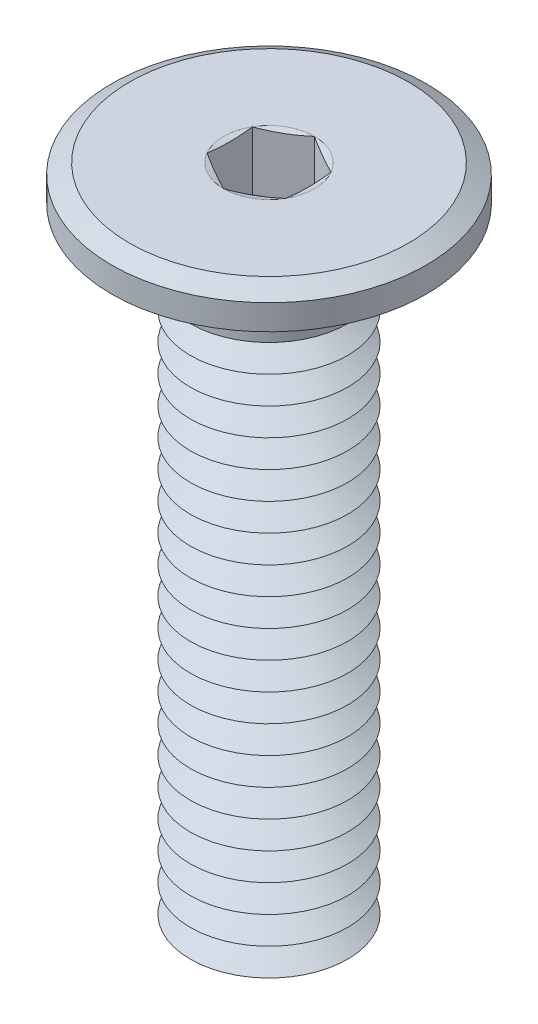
ISO-10303-21;
HEADER;
FILE_DESCRIPTION(('STEP AP214'),'2;1');
FILE_NAME('part.step','',(''),(''),'','','');
FILE_SCHEMA(('AUTOMOTIVE_DESIGN { 1 0 10303 214 1 1 1 1 }'));
ENDSEC;
DATA;
#1=APPLICATION_CONTEXT('core data for automotive mechanical design processes');
#2=APPLICATION_PROTOCOL_DEFINITION('international standard','automotive_design',2000,#1);
#3=PRODUCT_CONTEXT('',#1,'mechanical');
#4=PRODUCT('Part','Part','',(#3));
#5=PRODUCT_RELATED_PRODUCT_CATEGORY('part','',(#4));
#6=PRODUCT_DEFINITION_FORMATION('','',#4);
#7=PRODUCT_DEFINITION_CONTEXT('part definition',#1,'design');
#8=PRODUCT_DEFINITION('design','',#6,#7);
#9=PRODUCT_DEFINITION_SHAPE('','',#8);
#10=(LENGTH_UNIT() NAMED_UNIT(*) SI_UNIT(.MILLI.,.METRE.));
#11=(NAMED_UNIT(*) PLANE_ANGLE_UNIT() SI_UNIT($,.RADIAN.));
#12=(NAMED_UNIT(*) SI_UNIT($,.STERADIAN.) SOLID_ANGLE_UNIT());
#13=UNCERTAINTY_MEASURE_WITH_UNIT(LENGTH_MEASURE(1.E-05),#10,'distance_accuracy_value','');
#14=(GEOMETRIC_REPRESENTATION_CONTEXT(3) GLOBAL_UNCERTAINTY_ASSIGNED_CONTEXT((#13)) GLOBAL_UNIT_ASSIGNED_CONTEXT((#10,
#11,#12)) REPRESENTATION_CONTEXT('',''));
#15=CARTESIAN_POINT('',(0.,0.,0.));
#16=DIRECTION('',(0.,0.,1.));
#17=DIRECTION('',(1.,0.,0.));
#18=AXIS2_PLACEMENT_3D('',#15,#16,#17);
#19=CARTESIAN_POINT('',(0.,-15.85,0.));
#20=DIRECTION('',(0.,-1.,0.));
#21=DIRECTION('',(0.,0.,-1.));
#22=AXIS2_PLACEMENT_3D('',#19,#20,#21);
#23=CONICAL_SURFACE('',#22,2.,1.0471975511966);
#24=CARTESIAN_POINT('',(0.,-15.5,0.));
#25=DIRECTION('',(0.,1.,0.));
#26=DIRECTION('',(0.,0.,1.));
#27=AXIS2_PLACEMENT_3D('',#24,#25,#26);
#28=CIRCLE('',#27,1.39378221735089);
#29=CARTESIAN_POINT('',(0.,-15.5,1.39378221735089));
#30=VERTEX_POINT('',#29);
#31=EDGE_CURVE('E520',#30,#30,#28,.T.);
#32=ORIENTED_EDGE('',*,*,#31,.F.);
#33=EDGE_LOOP('',(#32));
#34=FACE_BOUND('',#33,.T.);
#35=CARTESIAN_POINT('',(0.,-15.85,0.));
#36=DIRECTION('',(0.,1.,0.));
#37=DIRECTION('',(0.,0.,1.));
#38=AXIS2_PLACEMENT_3D('',#35,#36,#37);
#39=CIRCLE('',#38,2.);
#40=CARTESIAN_POINT('',(0.,-15.85,2.));
#41=VERTEX_POINT('',#40);
#42=EDGE_CURVE('E524',#41,#41,#39,.T.);
#43=ORIENTED_EDGE('',*,*,#42,.T.);
#44=EDGE_LOOP('',(#43));
#45=FACE_BOUND('',#44,.T.);
#46=ADVANCED_FACE('F39',(#34,#45),#23,.T.);
#47=CARTESIAN_POINT('',(0.,-15.5,0.));
#48=DIRECTION('',(0.,1.,0.));
#49=DIRECTION('',(0.,0.,1.));
#50=AXIS2_PLACEMENT_3D('',#47,#48,#49);
#51=CONICAL_SURFACE('',#50,1.39378221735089,1.0471975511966);
#52=CARTESIAN_POINT('',(0.,-15.15,0.));
#53=DIRECTION('',(0.,1.,0.));
#54=DIRECTION('',(0.,0.,1.));
#55=AXIS2_PLACEMENT_3D('',#52,#53,#54);
#56=CIRCLE('',#55,2.);
#57=CARTESIAN_POINT('',(0.,-15.15,2.));
#58=VERTEX_POINT('',#57);
#59=EDGE_CURVE('E516',#58,#58,#56,.T.);
#60=ORIENTED_EDGE('',*,*,#59,.F.);
#61=EDGE_LOOP('',(#60));
#62=FACE_BOUND('',#61,.T.);
#63=ORIENTED_EDGE('',*,*,#31,.T.);
#64=EDGE_LOOP('',(#63));
#65=FACE_BOUND('',#64,.T.);
#66=ADVANCED_FACE('F233',(#62,#65),#51,.T.);
#67=CARTESIAN_POINT('',(0.,-16.9,0.));
#68=DIRECTION('',(0.,-1.,0.));
#69=DIRECTION('',(0.,0.,-1.));
#70=AXIS2_PLACEMENT_3D('',#67,#68,#69);
#71=PLANE('',#70);
#72=CARTESIAN_POINT('',(0.,-16.9,0.));
#73=DIRECTION('',(0.,1.,0.));
#74=DIRECTION('',(0.,0.,1.));
#75=AXIS2_PLACEMENT_3D('',#72,#73,#74);
#76=CIRCLE('',#75,1.39378221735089);
#77=CARTESIAN_POINT('',(0.,-16.9,1.39378221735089));
#78=VERTEX_POINT('',#77);
#79=EDGE_CURVE('E300',#78,#78,#76,.T.);
#80=ORIENTED_EDGE('',*,*,#79,.F.);
#81=EDGE_LOOP('',(#80));
#82=FACE_BOUND('',#81,.T.);
#83=ADVANCED_FACE('F239',(#82),#71,.T.);
#84=CARTESIAN_POINT('',(0.,-16.9,0.));
#85=DIRECTION('',(0.,1.,0.));
#86=DIRECTION('',(0.,0.,1.));
#87=AXIS2_PLACEMENT_3D('',#84,#85,#86);
#88=CONICAL_SURFACE('',#87,1.39378221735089,1.0471975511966);
#89=CARTESIAN_POINT('',(0.,-16.55,0.));
#90=DIRECTION('',(0.,1.,0.));
#91=DIRECTION('',(0.,0.,1.));
#92=AXIS2_PLACEMENT_3D('',#89,#90,#91);
#93=CIRCLE('',#92,2.);
#94=CARTESIAN_POINT('',(0.,-16.55,2.));
#95=VERTEX_POINT('',#94);
#96=EDGE_CURVE('E532',#95,#95,#93,.T.);
#97=ORIENTED_EDGE('',*,*,#96,.F.);
#98=EDGE_LOOP('',(#97));
#99=FACE_BOUND('',#98,.T.);
#100=ORIENTED_EDGE('',*,*,#79,.T.);
#101=EDGE_LOOP('',(#100));
#102=FACE_BOUND('',#101,.T.);
#103=ADVANCED_FACE('F254',(#99,#102),#88,.T.);
#104=CARTESIAN_POINT('',(0.,-16.55,0.));
#105=DIRECTION('',(0.,-1.,0.));
#106=DIRECTION('',(0.,0.,-1.));
#107=AXIS2_PLACEMENT_3D('',#104,#105,#106);
#108=CONICAL_SURFACE('',#107,2.,1.0471975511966);
#109=CARTESIAN_POINT('',(0.,-16.2,0.));
#110=DIRECTION('',(0.,1.,0.));
#111=DIRECTION('',(0.,0.,1.));
#112=AXIS2_PLACEMENT_3D('',#109,#110,#111);
#113=CIRCLE('',#112,1.39378221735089);
#114=CARTESIAN_POINT('',(0.,-16.2,1.39378221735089));
#115=VERTEX_POINT('',#114);
#116=EDGE_CURVE('E528',#115,#115,#113,.T.);
#117=ORIENTED_EDGE('',*,*,#116,.F.);
#118=EDGE_LOOP('',(#117));
#119=FACE_BOUND('',#118,.T.);
#120=ORIENTED_EDGE('',*,*,#96,.T.);
#121=EDGE_LOOP('',(#120));
#122=FACE_BOUND('',#121,.T.);
#123=ADVANCED_FACE('F250',(#119,#122),#108,.T.);
#124=CARTESIAN_POINT('',(0.,-16.2,0.));
#125=DIRECTION('',(0.,1.,0.));
#126=DIRECTION('',(0.,0.,1.));
#127=AXIS2_PLACEMENT_3D('',#124,#125,#126);
#128=CONICAL_SURFACE('',#127,1.39378221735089,1.0471975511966);
#129=ORIENTED_EDGE('',*,*,#42,.F.);
#130=EDGE_LOOP('',(#129));
#131=FACE_BOUND('',#130,.T.);
#132=ORIENTED_EDGE('',*,*,#116,.T.);
#133=EDGE_LOOP('',(#132));
#134=FACE_BOUND('',#133,.T.);
#135=ADVANCED_FACE('F246',(#131,#134),#128,.T.);
#136=CARTESIAN_POINT('',(0.,-15.15,0.));
#137=DIRECTION('',(0.,-1.,0.));
#138=DIRECTION('',(0.,0.,-1.));
#139=AXIS2_PLACEMENT_3D('',#136,#137,#138);
#140=CONICAL_SURFACE('',#139,2.,1.0471975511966);
#141=CARTESIAN_POINT('',(0.,-14.8,0.));
#142=DIRECTION('',(0.,1.,0.));
#143=DIRECTION('',(0.,0.,1.));
#144=AXIS2_PLACEMENT_3D('',#141,#142,#143);
#145=CIRCLE('',#144,1.39378221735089);
#146=CARTESIAN_POINT('',(0.,-14.8,1.39378221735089));
#147=VERTEX_POINT('',#146);
#148=EDGE_CURVE('E512',#147,#147,#145,.T.);
#149=ORIENTED_EDGE('',*,*,#148,.F.);
#150=EDGE_LOOP('',(#149));
#151=FACE_BOUND('',#150,.T.);
#152=ORIENTED_EDGE('',*,*,#59,.T.);
#153=EDGE_LOOP('',(#152));
#154=FACE_BOUND('',#153,.T.);
#155=ADVANCED_FACE('F249',(#151,#154),#140,.T.);
#156=CARTESIAN_POINT('',(0.,-14.8,0.));
#157=DIRECTION('',(0.,1.,0.));
#158=DIRECTION('',(0.,0.,1.));
#159=AXIS2_PLACEMENT_3D('',#156,#157,#158);
#160=CONICAL_SURFACE('',#159,1.39378221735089,1.0471975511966);
#161=CARTESIAN_POINT('',(0.,-14.45,0.));
#162=DIRECTION('',(0.,1.,0.));
#163=DIRECTION('',(0.,0.,1.));
#164=AXIS2_PLACEMENT_3D('',#161,#162,#163);
#165=CIRCLE('',#164,2.);
#166=CARTESIAN_POINT('',(0.,-14.45,2.));
#167=VERTEX_POINT('',#166);
#168=EDGE_CURVE('E508',#167,#167,#165,.T.);
#169=ORIENTED_EDGE('',*,*,#168,.F.);
#170=EDGE_LOOP('',(#169));
#171=FACE_BOUND('',#170,.T.);
#172=ORIENTED_EDGE('',*,*,#148,.T.);
#173=EDGE_LOOP('',(#172));
#174=FACE_BOUND('',#173,.T.);
#175=ADVANCED_FACE('F730',(#171,#174),#160,.T.);
#176=CARTESIAN_POINT('',(0.,-14.45,0.));
#177=DIRECTION('',(0.,-1.,0.));
#178=DIRECTION('',(0.,0.,-1.));
#179=AXIS2_PLACEMENT_3D('',#176,#177,#178);
#180=CONICAL_SURFACE('',#179,2.,1.0471975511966);
#181=CARTESIAN_POINT('',(0.,-14.1,0.));
#182=DIRECTION('',(0.,1.,0.));
#183=DIRECTION('',(0.,0.,1.));
#184=AXIS2_PLACEMENT_3D('',#181,#182,#183);
#185=CIRCLE('',#184,1.39378221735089);
#186=CARTESIAN_POINT('',(0.,-14.1,1.39378221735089));
#187=VERTEX_POINT('',#186);
#188=EDGE_CURVE('E504',#187,#187,#185,.T.);
#189=ORIENTED_EDGE('',*,*,#188,.F.);
#190=EDGE_LOOP('',(#189));
#191=FACE_BOUND('',#190,.T.);
#192=ORIENTED_EDGE('',*,*,#168,.T.);
#193=EDGE_LOOP('',(#192));
#194=FACE_BOUND('',#193,.T.);
#195=ADVANCED_FACE('F726',(#191,#194),#180,.T.);
#196=CARTESIAN_POINT('',(0.,-14.1,0.));
#197=DIRECTION('',(0.,1.,0.));
#198=DIRECTION('',(0.,0.,1.));
#199=AXIS2_PLACEMENT_3D('',#196,#197,#198);
#200=CONICAL_SURFACE('',#199,1.39378221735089,1.0471975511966);
#201=CARTESIAN_POINT('',(0.,-13.75,0.));
#202=DIRECTION('',(0.,1.,0.));
#203=DIRECTION('',(0.,0.,1.));
#204=AXIS2_PLACEMENT_3D('',#201,#202,#203);
#205=CIRCLE('',#204,2.);
#206=CARTESIAN_POINT('',(0.,-13.75,2.));
#207=VERTEX_POINT('',#206);
#208=EDGE_CURVE('E501',#207,#207,#205,.T.);
#209=ORIENTED_EDGE('',*,*,#208,.F.);
#210=EDGE_LOOP('',(#209));
#211=FACE_BOUND('',#210,.T.);
#212=ORIENTED_EDGE('',*,*,#188,.T.);
#213=EDGE_LOOP('',(#212));
#214=FACE_BOUND('',#213,.T.);
#215=ADVANCED_FACE('F722',(#211,#214),#200,.T.);
#216=CARTESIAN_POINT('',(0.,-13.75,0.));
#217=DIRECTION('',(0.,-1.,0.));
#218=DIRECTION('',(0.,0.,-1.));
#219=AXIS2_PLACEMENT_3D('',#216,#217,#218);
#220=CONICAL_SURFACE('',#219,2.,1.0471975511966);
#221=CARTESIAN_POINT('',(0.,-13.4,0.));
#222=DIRECTION('',(0.,1.,0.));
#223=DIRECTION('',(0.,0.,1.));
#224=AXIS2_PLACEMENT_3D('',#221,#222,#223);
#225=CIRCLE('',#224,1.39378221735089);
#226=CARTESIAN_POINT('',(0.,-13.4,1.39378221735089));
#227=VERTEX_POINT('',#226);
#228=EDGE_CURVE('E498',#227,#227,#225,.T.);
#229=ORIENTED_EDGE('',*,*,#228,.F.);
#230=EDGE_LOOP('',(#229));
#231=FACE_BOUND('',#230,.T.);
#232=ORIENTED_EDGE('',*,*,#208,.T.);
#233=EDGE_LOOP('',(#232));
#234=FACE_BOUND('',#233,.T.);
#235=ADVANCED_FACE('F718',(#231,#234),#220,.T.);
#236=CARTESIAN_POINT('',(0.,-13.4,0.));
#237=DIRECTION('',(0.,1.,0.));
#238=DIRECTION('',(0.,0.,1.));
#239=AXIS2_PLACEMENT_3D('',#236,#237,#238);
#240=CONICAL_SURFACE('',#239,1.39378221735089,1.0471975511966);
#241=CARTESIAN_POINT('',(0.,-13.05,0.));
#242=DIRECTION('',(0.,1.,0.));
#243=DIRECTION('',(0.,0.,1.));
#244=AXIS2_PLACEMENT_3D('',#241,#242,#243);
#245=CIRCLE('',#244,2.);
#246=CARTESIAN_POINT('',(0.,-13.05,2.));
#247=VERTEX_POINT('',#246);
#248=EDGE_CURVE('E494',#247,#247,#245,.T.);
#249=ORIENTED_EDGE('',*,*,#248,.F.);
#250=EDGE_LOOP('',(#249));
#251=FACE_BOUND('',#250,.T.);
#252=ORIENTED_EDGE('',*,*,#228,.T.);
#253=EDGE_LOOP('',(#252));
#254=FACE_BOUND('',#253,.T.);
#255=ADVANCED_FACE('F714',(#251,#254),#240,.T.);
#256=CARTESIAN_POINT('',(0.,-13.05,0.));
#257=DIRECTION('',(0.,-1.,0.));
#258=DIRECTION('',(0.,0.,-1.));
#259=AXIS2_PLACEMENT_3D('',#256,#257,#258);
#260=CONICAL_SURFACE('',#259,2.,1.0471975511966);
#261=CARTESIAN_POINT('',(0.,-12.7,0.));
#262=DIRECTION('',(0.,1.,0.));
#263=DIRECTION('',(0.,0.,1.));
#264=AXIS2_PLACEMENT_3D('',#261,#262,#263);
#265=CIRCLE('',#264,1.39378221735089);
#266=CARTESIAN_POINT('',(0.,-12.7,1.39378221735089));
#267=VERTEX_POINT('',#266);
#268=EDGE_CURVE('E490',#267,#267,#265,.T.);
#269=ORIENTED_EDGE('',*,*,#268,.F.);
#270=EDGE_LOOP('',(#269));
#271=FACE_BOUND('',#270,.T.);
#272=ORIENTED_EDGE('',*,*,#248,.T.);
#273=EDGE_LOOP('',(#272));
#274=FACE_BOUND('',#273,.T.);
#275=ADVANCED_FACE('F710',(#271,#274),#260,.T.);
#276=CARTESIAN_POINT('',(0.,-12.7,0.));
#277=DIRECTION('',(0.,1.,0.));
#278=DIRECTION('',(0.,0.,1.));
#279=AXIS2_PLACEMENT_3D('',#276,#277,#278);
#280=CONICAL_SURFACE('',#279,1.39378221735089,1.0471975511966);
#281=CARTESIAN_POINT('',(0.,-12.35,0.));
#282=DIRECTION('',(0.,1.,0.));
#283=DIRECTION('',(0.,0.,1.));
#284=AXIS2_PLACEMENT_3D('',#281,#282,#283);
#285=CIRCLE('',#284,2.);
#286=CARTESIAN_POINT('',(0.,-12.35,2.));
#287=VERTEX_POINT('',#286);
#288=EDGE_CURVE('E486',#287,#287,#285,.T.);
#289=ORIENTED_EDGE('',*,*,#288,.F.);
#290=EDGE_LOOP('',(#289));
#291=FACE_BOUND('',#290,.T.);
#292=ORIENTED_EDGE('',*,*,#268,.T.);
#293=EDGE_LOOP('',(#292));
#294=FACE_BOUND('',#293,.T.);
#295=ADVANCED_FACE('F706',(#291,#294),#280,.T.);
#296=CARTESIAN_POINT('',(0.,-12.35,0.));
#297=DIRECTION('',(0.,-1.,0.));
#298=DIRECTION('',(0.,0.,-1.));
#299=AXIS2_PLACEMENT_3D('',#296,#297,#298);
#300=CONICAL_SURFACE('',#299,2.,1.0471975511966);
#301=CARTESIAN_POINT('',(0.,-12.,0.));
#302=DIRECTION('',(0.,1.,0.));
#303=DIRECTION('',(0.,0.,1.));
#304=AXIS2_PLACEMENT_3D('',#301,#302,#303);
#305=CIRCLE('',#304,1.39378221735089);
#306=CARTESIAN_POINT('',(0.,-12.,1.39378221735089));
#307=VERTEX_POINT('',#306);
#308=EDGE_CURVE('E482',#307,#307,#305,.T.);
#309=ORIENTED_EDGE('',*,*,#308,.F.);
#310=EDGE_LOOP('',(#309));
#311=FACE_BOUND('',#310,.T.);
#312=ORIENTED_EDGE('',*,*,#288,.T.);
#313=EDGE_LOOP('',(#312));
#314=FACE_BOUND('',#313,.T.);
#315=ADVANCED_FACE('F702',(#311,#314),#300,.T.);
#316=CARTESIAN_POINT('',(0.,-12.,0.));
#317=DIRECTION('',(0.,1.,0.));
#318=DIRECTION('',(0.,0.,1.));
#319=AXIS2_PLACEMENT_3D('',#316,#317,#318);
#320=CONICAL_SURFACE('',#319,1.39378221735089,1.0471975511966);
#321=CARTESIAN_POINT('',(0.,-11.65,0.));
#322=DIRECTION('',(0.,1.,0.));
#323=DIRECTION('',(0.,0.,1.));
#324=AXIS2_PLACEMENT_3D('',#321,#322,#323);
#325=CIRCLE('',#324,2.);
#326=CARTESIAN_POINT('',(0.,-11.65,2.));
#327=VERTEX_POINT('',#326);
#328=EDGE_CURVE('E478',#327,#327,#325,.T.);
#329=ORIENTED_EDGE('',*,*,#328,.F.);
#330=EDGE_LOOP('',(#329));
#331=FACE_BOUND('',#330,.T.);
#332=ORIENTED_EDGE('',*,*,#308,.T.);
#333=EDGE_LOOP('',(#332));
#334=FACE_BOUND('',#333,.T.);
#335=ADVANCED_FACE('F698',(#331,#334),#320,.T.);
#336=CARTESIAN_POINT('',(0.,-11.65,0.));
#337=DIRECTION('',(0.,-1.,0.));
#338=DIRECTION('',(0.,0.,-1.));
#339=AXIS2_PLACEMENT_3D('',#336,#337,#338);
#340=CONICAL_SURFACE('',#339,2.,1.0471975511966);
#341=CARTESIAN_POINT('',(0.,-11.3,0.));
#342=DIRECTION('',(0.,1.,0.));
#343=DIRECTION('',(0.,0.,1.));
#344=AXIS2_PLACEMENT_3D('',#341,#342,#343);
#345=CIRCLE('',#344,1.39378221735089);
#346=CARTESIAN_POINT('',(0.,-11.3,1.39378221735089));
#347=VERTEX_POINT('',#346);
#348=EDGE_CURVE('E474',#347,#347,#345,.T.);
#349=ORIENTED_EDGE('',*,*,#348,.F.);
#350=EDGE_LOOP('',(#349));
#351=FACE_BOUND('',#350,.T.);
#352=ORIENTED_EDGE('',*,*,#328,.T.);
#353=EDGE_LOOP('',(#352));
#354=FACE_BOUND('',#353,.T.);
#355=ADVANCED_FACE('F694',(#351,#354),#340,.T.);
#356=CARTESIAN_POINT('',(0.,-11.3,0.));
#357=DIRECTION('',(0.,1.,0.));
#358=DIRECTION('',(0.,0.,1.));
#359=AXIS2_PLACEMENT_3D('',#356,#357,#358);
#360=CONICAL_SURFACE('',#359,1.39378221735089,1.0471975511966);
#361=CARTESIAN_POINT('',(0.,-10.95,0.));
#362=DIRECTION('',(0.,1.,0.));
#363=DIRECTION('',(0.,0.,1.));
#364=AXIS2_PLACEMENT_3D('',#361,#362,#363);
#365=CIRCLE('',#364,2.);
#366=CARTESIAN_POINT('',(0.,-10.95,2.));
#367=VERTEX_POINT('',#366);
#368=EDGE_CURVE('E470',#367,#367,#365,.T.);
#369=ORIENTED_EDGE('',*,*,#368,.F.);
#370=EDGE_LOOP('',(#369));
#371=FACE_BOUND('',#370,.T.);
#372=ORIENTED_EDGE('',*,*,#348,.T.);
#373=EDGE_LOOP('',(#372));
#374=FACE_BOUND('',#373,.T.);
#375=ADVANCED_FACE('F690',(#371,#374),#360,.T.);
#376=CARTESIAN_POINT('',(0.,-10.95,0.));
#377=DIRECTION('',(0.,-1.,0.));
#378=DIRECTION('',(0.,0.,-1.));
#379=AXIS2_PLACEMENT_3D('',#376,#377,#378);
#380=CONICAL_SURFACE('',#379,2.,1.0471975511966);
#381=CARTESIAN_POINT('',(0.,-10.6,0.));
#382=DIRECTION('',(0.,1.,0.));
#383=DIRECTION('',(0.,0.,1.));
#384=AXIS2_PLACEMENT_3D('',#381,#382,#383);
#385=CIRCLE('',#384,1.39378221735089);
#386=CARTESIAN_POINT('',(0.,-10.6,1.39378221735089));
#387=VERTEX_POINT('',#386);
#388=EDGE_CURVE('E466',#387,#387,#385,.T.);
#389=ORIENTED_EDGE('',*,*,#388,.F.);
#390=EDGE_LOOP('',(#389));
#391=FACE_BOUND('',#390,.T.);
#392=ORIENTED_EDGE('',*,*,#368,.T.);
#393=EDGE_LOOP('',(#392));
#394=FACE_BOUND('',#393,.T.);
#395=ADVANCED_FACE('F686',(#391,#394),#380,.T.);
#396=CARTESIAN_POINT('',(0.,-10.6,0.));
#397=DIRECTION('',(0.,1.,0.));
#398=DIRECTION('',(0.,0.,1.));
#399=AXIS2_PLACEMENT_3D('',#396,#397,#398);
#400=CONICAL_SURFACE('',#399,1.39378221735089,1.0471975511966);
#401=CARTESIAN_POINT('',(0.,-10.25,0.));
#402=DIRECTION('',(0.,1.,0.));
#403=DIRECTION('',(0.,0.,1.));
#404=AXIS2_PLACEMENT_3D('',#401,#402,#403);
#405=CIRCLE('',#404,2.);
#406=CARTESIAN_POINT('',(0.,-10.25,2.));
#407=VERTEX_POINT('',#406);
#408=EDGE_CURVE('E462',#407,#407,#405,.T.);
#409=ORIENTED_EDGE('',*,*,#408,.F.);
#410=EDGE_LOOP('',(#409));
#411=FACE_BOUND('',#410,.T.);
#412=ORIENTED_EDGE('',*,*,#388,.T.);
#413=EDGE_LOOP('',(#412));
#414=FACE_BOUND('',#413,.T.);
#415=ADVANCED_FACE('F682',(#411,#414),#400,.T.);
#416=CARTESIAN_POINT('',(0.,-10.25,0.));
#417=DIRECTION('',(0.,-1.,0.));
#418=DIRECTION('',(0.,0.,-1.));
#419=AXIS2_PLACEMENT_3D('',#416,#417,#418);
#420=CONICAL_SURFACE('',#419,2.,1.0471975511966);
#421=CARTESIAN_POINT('',(0.,-9.9,0.));
#422=DIRECTION('',(0.,1.,0.));
#423=DIRECTION('',(0.,0.,1.));
#424=AXIS2_PLACEMENT_3D('',#421,#422,#423);
#425=CIRCLE('',#424,1.39378221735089);
#426=CARTESIAN_POINT('',(0.,-9.9,1.39378221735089));
#427=VERTEX_POINT('',#426);
#428=EDGE_CURVE('E459',#427,#427,#425,.T.);
#429=ORIENTED_EDGE('',*,*,#428,.F.);
#430=EDGE_LOOP('',(#429));
#431=FACE_BOUND('',#430,.T.);
#432=ORIENTED_EDGE('',*,*,#408,.T.);
#433=EDGE_LOOP('',(#432));
#434=FACE_BOUND('',#433,.T.);
#435=ADVANCED_FACE('F678',(#431,#434),#420,.T.);
#436=CARTESIAN_POINT('',(0.,-9.9,0.));
#437=DIRECTION('',(0.,1.,0.));
#438=DIRECTION('',(0.,0.,1.));
#439=AXIS2_PLACEMENT_3D('',#436,#437,#438);
#440=CONICAL_SURFACE('',#439,1.39378221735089,1.0471975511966);
#441=CARTESIAN_POINT('',(0.,-9.55,0.));
#442=DIRECTION('',(0.,1.,0.));
#443=DIRECTION('',(0.,0.,1.));
#444=AXIS2_PLACEMENT_3D('',#441,#442,#443);
#445=CIRCLE('',#444,2.);
#446=CARTESIAN_POINT('',(0.,-9.55,2.));
#447=VERTEX_POINT('',#446);
#448=EDGE_CURVE('E456',#447,#447,#445,.T.);
#449=ORIENTED_EDGE('',*,*,#448,.F.);
#450=EDGE_LOOP('',(#449));
#451=FACE_BOUND('',#450,.T.);
#452=ORIENTED_EDGE('',*,*,#428,.T.);
#453=EDGE_LOOP('',(#452));
#454=FACE_BOUND('',#453,.T.);
#455=ADVANCED_FACE('F674',(#451,#454),#440,.T.);
#456=CARTESIAN_POINT('',(0.,-9.55,0.));
#457=DIRECTION('',(0.,-1.,0.));
#458=DIRECTION('',(0.,0.,-1.));
#459=AXIS2_PLACEMENT_3D('',#456,#457,#458);
#460=CONICAL_SURFACE('',#459,2.,1.0471975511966);
#461=CARTESIAN_POINT('',(0.,-9.2,0.));
#462=DIRECTION('',(0.,1.,0.));
#463=DIRECTION('',(0.,0.,1.));
#464=AXIS2_PLACEMENT_3D('',#461,#462,#463);
#465=CIRCLE('',#464,1.39378221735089);
#466=CARTESIAN_POINT('',(0.,-9.2,1.39378221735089));
#467=VERTEX_POINT('',#466);
#468=EDGE_CURVE('E452',#467,#467,#465,.T.);
#469=ORIENTED_EDGE('',*,*,#468,.F.);
#470=EDGE_LOOP('',(#469));
#471=FACE_BOUND('',#470,.T.);
#472=ORIENTED_EDGE('',*,*,#448,.T.);
#473=EDGE_LOOP('',(#472));
#474=FACE_BOUND('',#473,.T.);
#475=ADVANCED_FACE('F670',(#471,#474),#460,.T.);
#476=CARTESIAN_POINT('',(0.,-9.2,0.));
#477=DIRECTION('',(0.,1.,0.));
#478=DIRECTION('',(0.,0.,1.));
#479=AXIS2_PLACEMENT_3D('',#476,#477,#478);
#480=CONICAL_SURFACE('',#479,1.39378221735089,1.0471975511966);
#481=CARTESIAN_POINT('',(0.,-8.85,0.));
#482=DIRECTION('',(0.,1.,0.));
#483=DIRECTION('',(0.,0.,1.));
#484=AXIS2_PLACEMENT_3D('',#481,#482,#483);
#485=CIRCLE('',#484,2.);
#486=CARTESIAN_POINT('',(0.,-8.85,2.));
#487=VERTEX_POINT('',#486);
#488=EDGE_CURVE('E448',#487,#487,#485,.T.);
#489=ORIENTED_EDGE('',*,*,#488,.F.);
#490=EDGE_LOOP('',(#489));
#491=FACE_BOUND('',#490,.T.);
#492=ORIENTED_EDGE('',*,*,#468,.T.);
#493=EDGE_LOOP('',(#492));
#494=FACE_BOUND('',#493,.T.);
#495=ADVANCED_FACE('F666',(#491,#494),#480,.T.);
#496=CARTESIAN_POINT('',(0.,-8.85,0.));
#497=DIRECTION('',(0.,-1.,0.));
#498=DIRECTION('',(0.,0.,-1.));
#499=AXIS2_PLACEMENT_3D('',#496,#497,#498);
#500=CONICAL_SURFACE('',#499,2.,1.0471975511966);
#501=CARTESIAN_POINT('',(0.,-8.5,0.));
#502=DIRECTION('',(0.,1.,0.));
#503=DIRECTION('',(0.,0.,1.));
#504=AXIS2_PLACEMENT_3D('',#501,#502,#503);
#505=CIRCLE('',#504,1.39378221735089);
#506=CARTESIAN_POINT('',(0.,-8.5,1.39378221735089));
#507=VERTEX_POINT('',#506);
#508=EDGE_CURVE('E444',#507,#507,#505,.T.);
#509=ORIENTED_EDGE('',*,*,#508,.F.);
#510=EDGE_LOOP('',(#509));
#511=FACE_BOUND('',#510,.T.);
#512=ORIENTED_EDGE('',*,*,#488,.T.);
#513=EDGE_LOOP('',(#512));
#514=FACE_BOUND('',#513,.T.);
#515=ADVANCED_FACE('F662',(#511,#514),#500,.T.);
#516=CARTESIAN_POINT('',(0.,-8.5,0.));
#517=DIRECTION('',(0.,1.,0.));
#518=DIRECTION('',(0.,0.,1.));
#519=AXIS2_PLACEMENT_3D('',#516,#517,#518);
#520=CONICAL_SURFACE('',#519,1.39378221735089,1.0471975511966);
#521=CARTESIAN_POINT('',(0.,-8.15,0.));
#522=DIRECTION('',(0.,1.,0.));
#523=DIRECTION('',(0.,0.,1.));
#524=AXIS2_PLACEMENT_3D('',#521,#522,#523);
#525=CIRCLE('',#524,2.);
#526=CARTESIAN_POINT('',(0.,-8.15,2.));
#527=VERTEX_POINT('',#526);
#528=EDGE_CURVE('E441',#527,#527,#525,.T.);
#529=ORIENTED_EDGE('',*,*,#528,.F.);
#530=EDGE_LOOP('',(#529));
#531=FACE_BOUND('',#530,.T.);
#532=ORIENTED_EDGE('',*,*,#508,.T.);
#533=EDGE_LOOP('',(#532));
#534=FACE_BOUND('',#533,.T.);
#535=ADVANCED_FACE('F658',(#531,#534),#520,.T.);
#536=CARTESIAN_POINT('',(0.,-8.15,0.));
#537=DIRECTION('',(0.,-1.,0.));
#538=DIRECTION('',(0.,0.,-1.));
#539=AXIS2_PLACEMENT_3D('',#536,#537,#538);
#540=CONICAL_SURFACE('',#539,2.,1.0471975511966);
#541=CARTESIAN_POINT('',(0.,-7.8,0.));
#542=DIRECTION('',(0.,1.,0.));
#543=DIRECTION('',(0.,0.,1.));
#544=AXIS2_PLACEMENT_3D('',#541,#542,#543);
#545=CIRCLE('',#544,1.39378221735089);
#546=CARTESIAN_POINT('',(0.,-7.8,1.39378221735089));
#547=VERTEX_POINT('',#546);
#548=EDGE_CURVE('E437',#547,#547,#545,.T.);
#549=ORIENTED_EDGE('',*,*,#548,.F.);
#550=EDGE_LOOP('',(#549));
#551=FACE_BOUND('',#550,.T.);
#552=ORIENTED_EDGE('',*,*,#528,.T.);
#553=EDGE_LOOP('',(#552));
#554=FACE_BOUND('',#553,.T.);
#555=ADVANCED_FACE('F654',(#551,#554),#540,.T.);
#556=CARTESIAN_POINT('',(0.,-7.8,0.));
#557=DIRECTION('',(0.,1.,0.));
#558=DIRECTION('',(0.,0.,1.));
#559=AXIS2_PLACEMENT_3D('',#556,#557,#558);
#560=CONICAL_SURFACE('',#559,1.39378221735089,1.0471975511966);
#561=CARTESIAN_POINT('',(0.,-7.45,0.));
#562=DIRECTION('',(0.,1.,0.));
#563=DIRECTION('',(0.,0.,1.));
#564=AXIS2_PLACEMENT_3D('',#561,#562,#563);
#565=CIRCLE('',#564,2.);
#566=CARTESIAN_POINT('',(0.,-7.45,2.));
#567=VERTEX_POINT('',#566);
#568=EDGE_CURVE('E434',#567,#567,#565,.T.);
#569=ORIENTED_EDGE('',*,*,#568,.F.);
#570=EDGE_LOOP('',(#569));
#571=FACE_BOUND('',#570,.T.);
#572=ORIENTED_EDGE('',*,*,#548,.T.);
#573=EDGE_LOOP('',(#572));
#574=FACE_BOUND('',#573,.T.);
#575=ADVANCED_FACE('F650',(#571,#574),#560,.T.);
#576=CARTESIAN_POINT('',(0.,-7.45,0.));
#577=DIRECTION('',(0.,-1.,0.));
#578=DIRECTION('',(0.,0.,-1.));
#579=AXIS2_PLACEMENT_3D('',#576,#577,#578);
#580=CONICAL_SURFACE('',#579,2.,1.0471975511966);
#581=CARTESIAN_POINT('',(0.,-7.1,0.));
#582=DIRECTION('',(0.,1.,0.));
#583=DIRECTION('',(0.,0.,1.));
#584=AXIS2_PLACEMENT_3D('',#581,#582,#583);
#585=CIRCLE('',#584,1.39378221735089);
#586=CARTESIAN_POINT('',(0.,-7.1,1.39378221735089));
#587=VERTEX_POINT('',#586);
#588=EDGE_CURVE('E430',#587,#587,#585,.T.);
#589=ORIENTED_EDGE('',*,*,#588,.F.);
#590=EDGE_LOOP('',(#589));
#591=FACE_BOUND('',#590,.T.);
#592=ORIENTED_EDGE('',*,*,#568,.T.);
#593=EDGE_LOOP('',(#592));
#594=FACE_BOUND('',#593,.T.);
#595=ADVANCED_FACE('F646',(#591,#594),#580,.T.);
#596=CARTESIAN_POINT('',(0.,-7.1,0.));
#597=DIRECTION('',(0.,1.,0.));
#598=DIRECTION('',(0.,0.,1.));
#599=AXIS2_PLACEMENT_3D('',#596,#597,#598);
#600=CONICAL_SURFACE('',#599,1.39378221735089,1.0471975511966);
#601=CARTESIAN_POINT('',(0.,-6.75,0.));
#602=DIRECTION('',(0.,1.,0.));
#603=DIRECTION('',(0.,0.,1.));
#604=AXIS2_PLACEMENT_3D('',#601,#602,#603);
#605=CIRCLE('',#604,2.);
#606=CARTESIAN_POINT('',(0.,-6.75,2.));
#607=VERTEX_POINT('',#606);
#608=EDGE_CURVE('E426',#607,#607,#605,.T.);
#609=ORIENTED_EDGE('',*,*,#608,.F.);
#610=EDGE_LOOP('',(#609));
#611=FACE_BOUND('',#610,.T.);
#612=ORIENTED_EDGE('',*,*,#588,.T.);
#613=EDGE_LOOP('',(#612));
#614=FACE_BOUND('',#613,.T.);
#615=ADVANCED_FACE('F642',(#611,#614),#600,.T.);
#616=CARTESIAN_POINT('',(0.,-6.75,0.));
#617=DIRECTION('',(0.,-1.,0.));
#618=DIRECTION('',(0.,0.,-1.));
#619=AXIS2_PLACEMENT_3D('',#616,#617,#618);
#620=CONICAL_SURFACE('',#619,2.,1.0471975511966);
#621=CARTESIAN_POINT('',(0.,-6.4,0.));
#622=DIRECTION('',(0.,1.,0.));
#623=DIRECTION('',(0.,0.,1.));
#624=AXIS2_PLACEMENT_3D('',#621,#622,#623);
#625=CIRCLE('',#624,1.39378221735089);
#626=CARTESIAN_POINT('',(0.,-6.4,1.39378221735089));
#627=VERTEX_POINT('',#626);
#628=EDGE_CURVE('E422',#627,#627,#625,.T.);
#629=ORIENTED_EDGE('',*,*,#628,.F.);
#630=EDGE_LOOP('',(#629));
#631=FACE_BOUND('',#630,.T.);
#632=ORIENTED_EDGE('',*,*,#608,.T.);
#633=EDGE_LOOP('',(#632));
#634=FACE_BOUND('',#633,.T.);
#635=ADVANCED_FACE('F638',(#631,#634),#620,.T.);
#636=CARTESIAN_POINT('',(0.,-6.4,0.));
#637=DIRECTION('',(0.,1.,0.));
#638=DIRECTION('',(0.,0.,1.));
#639=AXIS2_PLACEMENT_3D('',#636,#637,#638);
#640=CONICAL_SURFACE('',#639,1.39378221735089,1.0471975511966);
#641=CARTESIAN_POINT('',(0.,-6.05,0.));
#642=DIRECTION('',(0.,1.,0.));
#643=DIRECTION('',(0.,0.,1.));
#644=AXIS2_PLACEMENT_3D('',#641,#642,#643);
#645=CIRCLE('',#644,2.);
#646=CARTESIAN_POINT('',(0.,-6.05,2.));
#647=VERTEX_POINT('',#646);
#648=EDGE_CURVE('E418',#647,#647,#645,.T.);
#649=ORIENTED_EDGE('',*,*,#648,.F.);
#650=EDGE_LOOP('',(#649));
#651=FACE_BOUND('',#650,.T.);
#652=ORIENTED_EDGE('',*,*,#628,.T.);
#653=EDGE_LOOP('',(#652));
#654=FACE_BOUND('',#653,.T.);
#655=ADVANCED_FACE('F634',(#651,#654),#640,.T.);
#656=CARTESIAN_POINT('',(0.,-6.05,0.));
#657=DIRECTION('',(0.,-1.,0.));
#658=DIRECTION('',(0.,0.,-1.));
#659=AXIS2_PLACEMENT_3D('',#656,#657,#658);
#660=CONICAL_SURFACE('',#659,2.,1.0471975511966);
#661=CARTESIAN_POINT('',(0.,-5.7,0.));
#662=DIRECTION('',(0.,1.,0.));
#663=DIRECTION('',(0.,0.,1.));
#664=AXIS2_PLACEMENT_3D('',#661,#662,#663);
#665=CIRCLE('',#664,1.39378221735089);
#666=CARTESIAN_POINT('',(0.,-5.7,1.39378221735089));
#667=VERTEX_POINT('',#666);
#668=EDGE_CURVE('E414',#667,#667,#665,.T.);
#669=ORIENTED_EDGE('',*,*,#668,.F.);
#670=EDGE_LOOP('',(#669));
#671=FACE_BOUND('',#670,.T.);
#672=ORIENTED_EDGE('',*,*,#648,.T.);
#673=EDGE_LOOP('',(#672));
#674=FACE_BOUND('',#673,.T.);
#675=ADVANCED_FACE('F630',(#671,#674),#660,.T.);
#676=CARTESIAN_POINT('',(0.,-5.7,0.));
#677=DIRECTION('',(0.,1.,0.));
#678=DIRECTION('',(0.,0.,1.));
#679=AXIS2_PLACEMENT_3D('',#676,#677,#678);
#680=CONICAL_SURFACE('',#679,1.39378221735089,1.0471975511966);
#681=CARTESIAN_POINT('',(0.,-5.35,0.));
#682=DIRECTION('',(0.,1.,0.));
#683=DIRECTION('',(0.,0.,1.));
#684=AXIS2_PLACEMENT_3D('',#681,#682,#683);
#685=CIRCLE('',#684,2.);
#686=CARTESIAN_POINT('',(0.,-5.35,2.));
#687=VERTEX_POINT('',#686);
#688=EDGE_CURVE('E410',#687,#687,#685,.T.);
#689=ORIENTED_EDGE('',*,*,#688,.F.);
#690=EDGE_LOOP('',(#689));
#691=FACE_BOUND('',#690,.T.);
#692=ORIENTED_EDGE('',*,*,#668,.T.);
#693=EDGE_LOOP('',(#692));
#694=FACE_BOUND('',#693,.T.);
#695=ADVANCED_FACE('F626',(#691,#694),#680,.T.);
#696=CARTESIAN_POINT('',(0.,-5.35,0.));
#697=DIRECTION('',(0.,-1.,0.));
#698=DIRECTION('',(0.,0.,-1.));
#699=AXIS2_PLACEMENT_3D('',#696,#697,#698);
#700=CONICAL_SURFACE('',#699,2.,1.0471975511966);
#701=CARTESIAN_POINT('',(0.,-5.,0.));
#702=DIRECTION('',(0.,1.,0.));
#703=DIRECTION('',(0.,0.,1.));
#704=AXIS2_PLACEMENT_3D('',#701,#702,#703);
#705=CIRCLE('',#704,1.39378221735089);
#706=CARTESIAN_POINT('',(0.,-5.,1.39378221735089));
#707=VERTEX_POINT('',#706);
#708=EDGE_CURVE('E407',#707,#707,#705,.T.);
#709=ORIENTED_EDGE('',*,*,#708,.F.);
#710=EDGE_LOOP('',(#709));
#711=FACE_BOUND('',#710,.T.);
#712=ORIENTED_EDGE('',*,*,#688,.T.);
#713=EDGE_LOOP('',(#712));
#714=FACE_BOUND('',#713,.T.);
#715=ADVANCED_FACE('F622',(#711,#714),#700,.T.);
#716=CARTESIAN_POINT('',(0.,-5.,0.));
#717=DIRECTION('',(0.,1.,0.));
#718=DIRECTION('',(0.,0.,1.));
#719=AXIS2_PLACEMENT_3D('',#716,#717,#718);
#720=CONICAL_SURFACE('',#719,1.39378221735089,1.0471975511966);
#721=CARTESIAN_POINT('',(0.,-4.65,0.));
#722=DIRECTION('',(0.,1.,0.));
#723=DIRECTION('',(0.,0.,1.));
#724=AXIS2_PLACEMENT_3D('',#721,#722,#723);
#725=CIRCLE('',#724,2.);
#726=CARTESIAN_POINT('',(0.,-4.65,2.));
#727=VERTEX_POINT('',#726);
#728=EDGE_CURVE('E403',#727,#727,#725,.T.);
#729=ORIENTED_EDGE('',*,*,#728,.F.);
#730=EDGE_LOOP('',(#729));
#731=FACE_BOUND('',#730,.T.);
#732=ORIENTED_EDGE('',*,*,#708,.T.);
#733=EDGE_LOOP('',(#732));
#734=FACE_BOUND('',#733,.T.);
#735=ADVANCED_FACE('F618',(#731,#734),#720,.T.);
#736=CARTESIAN_POINT('',(0.,-4.65,0.));
#737=DIRECTION('',(0.,-1.,0.));
#738=DIRECTION('',(0.,0.,-1.));
#739=AXIS2_PLACEMENT_3D('',#736,#737,#738);
#740=CONICAL_SURFACE('',#739,2.,1.0471975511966);
#741=CARTESIAN_POINT('',(0.,-4.3,0.));
#742=DIRECTION('',(0.,1.,0.));
#743=DIRECTION('',(0.,0.,1.));
#744=AXIS2_PLACEMENT_3D('',#741,#742,#743);
#745=CIRCLE('',#744,1.39378221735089);
#746=CARTESIAN_POINT('',(0.,-4.3,1.39378221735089));
#747=VERTEX_POINT('',#746);
#748=EDGE_CURVE('E399',#747,#747,#745,.T.);
#749=ORIENTED_EDGE('',*,*,#748,.F.);
#750=EDGE_LOOP('',(#749));
#751=FACE_BOUND('',#750,.T.);
#752=ORIENTED_EDGE('',*,*,#728,.T.);
#753=EDGE_LOOP('',(#752));
#754=FACE_BOUND('',#753,.T.);
#755=ADVANCED_FACE('F614',(#751,#754),#740,.T.);
#756=CARTESIAN_POINT('',(0.,-4.3,0.));
#757=DIRECTION('',(0.,1.,0.));
#758=DIRECTION('',(0.,0.,1.));
#759=AXIS2_PLACEMENT_3D('',#756,#757,#758);
#760=CONICAL_SURFACE('',#759,1.39378221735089,1.0471975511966);
#761=CARTESIAN_POINT('',(0.,-3.95,0.));
#762=DIRECTION('',(0.,1.,0.));
#763=DIRECTION('',(0.,0.,1.));
#764=AXIS2_PLACEMENT_3D('',#761,#762,#763);
#765=CIRCLE('',#764,2.);
#766=CARTESIAN_POINT('',(0.,-3.95,2.));
#767=VERTEX_POINT('',#766);
#768=EDGE_CURVE('E395',#767,#767,#765,.T.);
#769=ORIENTED_EDGE('',*,*,#768,.F.);
#770=EDGE_LOOP('',(#769));
#771=FACE_BOUND('',#770,.T.);
#772=ORIENTED_EDGE('',*,*,#748,.T.);
#773=EDGE_LOOP('',(#772));
#774=FACE_BOUND('',#773,.T.);
#775=ADVANCED_FACE('F610',(#771,#774),#760,.T.);
#776=CARTESIAN_POINT('',(0.,-3.95,0.));
#777=DIRECTION('',(0.,-1.,0.));
#778=DIRECTION('',(0.,0.,-1.));
#779=AXIS2_PLACEMENT_3D('',#776,#777,#778);
#780=CONICAL_SURFACE('',#779,2.,1.0471975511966);
#781=CARTESIAN_POINT('',(0.,-3.6,0.));
#782=DIRECTION('',(0.,1.,0.));
#783=DIRECTION('',(0.,0.,1.));
#784=AXIS2_PLACEMENT_3D('',#781,#782,#783);
#785=CIRCLE('',#784,1.39378221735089);
#786=CARTESIAN_POINT('',(0.,-3.6,1.39378221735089));
#787=VERTEX_POINT('',#786);
#788=EDGE_CURVE('E391',#787,#787,#785,.T.);
#789=ORIENTED_EDGE('',*,*,#788,.F.);
#790=EDGE_LOOP('',(#789));
#791=FACE_BOUND('',#790,.T.);
#792=ORIENTED_EDGE('',*,*,#768,.T.);
#793=EDGE_LOOP('',(#792));
#794=FACE_BOUND('',#793,.T.);
#795=ADVANCED_FACE('F606',(#791,#794),#780,.T.);
#796=CARTESIAN_POINT('',(0.,-3.6,0.));
#797=DIRECTION('',(0.,1.,0.));
#798=DIRECTION('',(0.,0.,1.));
#799=AXIS2_PLACEMENT_3D('',#796,#797,#798);
#800=CONICAL_SURFACE('',#799,1.39378221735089,1.0471975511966);
#801=CARTESIAN_POINT('',(0.,-3.25,0.));
#802=DIRECTION('',(0.,1.,0.));
#803=DIRECTION('',(0.,0.,1.));
#804=AXIS2_PLACEMENT_3D('',#801,#802,#803);
#805=CIRCLE('',#804,2.);
#806=CARTESIAN_POINT('',(0.,-3.25,2.));
#807=VERTEX_POINT('',#806);
#808=EDGE_CURVE('E387',#807,#807,#805,.T.);
#809=ORIENTED_EDGE('',*,*,#808,.F.);
#810=EDGE_LOOP('',(#809));
#811=FACE_BOUND('',#810,.T.);
#812=ORIENTED_EDGE('',*,*,#788,.T.);
#813=EDGE_LOOP('',(#812));
#814=FACE_BOUND('',#813,.T.);
#815=ADVANCED_FACE('F602',(#811,#814),#800,.T.);
#816=CARTESIAN_POINT('',(0.,-3.25,0.));
#817=DIRECTION('',(0.,-1.,0.));
#818=DIRECTION('',(0.,0.,-1.));
#819=AXIS2_PLACEMENT_3D('',#816,#817,#818);
#820=CONICAL_SURFACE('',#819,2.,1.0471975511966);
#821=CARTESIAN_POINT('',(0.,-2.9,0.));
#822=DIRECTION('',(0.,1.,0.));
#823=DIRECTION('',(0.,0.,1.));
#824=AXIS2_PLACEMENT_3D('',#821,#822,#823);
#825=CIRCLE('',#824,1.39378221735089);
#826=CARTESIAN_POINT('',(0.,-2.9,1.39378221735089));
#827=VERTEX_POINT('',#826);
#828=EDGE_CURVE('E383',#827,#827,#825,.T.);
#829=ORIENTED_EDGE('',*,*,#828,.F.);
#830=EDGE_LOOP('',(#829));
#831=FACE_BOUND('',#830,.T.);
#832=ORIENTED_EDGE('',*,*,#808,.T.);
#833=EDGE_LOOP('',(#832));
#834=FACE_BOUND('',#833,.T.);
#835=ADVANCED_FACE('F598',(#831,#834),#820,.T.);
#836=CARTESIAN_POINT('',(0.,-2.9,0.));
#837=DIRECTION('',(0.,1.,0.));
#838=DIRECTION('',(0.,0.,1.));
#839=AXIS2_PLACEMENT_3D('',#836,#837,#838);
#840=CONICAL_SURFACE('',#839,1.39378221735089,1.0471975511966);
#841=CARTESIAN_POINT('',(0.,-2.55,0.));
#842=DIRECTION('',(0.,1.,0.));
#843=DIRECTION('',(0.,0.,1.));
#844=AXIS2_PLACEMENT_3D('',#841,#842,#843);
#845=CIRCLE('',#844,2.);
#846=CARTESIAN_POINT('',(0.,-2.55,2.));
#847=VERTEX_POINT('',#846);
#848=EDGE_CURVE('E368',#847,#847,#845,.T.);
#849=ORIENTED_EDGE('',*,*,#848,.F.);
#850=EDGE_LOOP('',(#849));
#851=FACE_BOUND('',#850,.T.);
#852=ORIENTED_EDGE('',*,*,#828,.T.);
#853=EDGE_LOOP('',(#852));
#854=FACE_BOUND('',#853,.T.);
#855=ADVANCED_FACE('F274',(#851,#854),#840,.T.);
#856=CARTESIAN_POINT('',(0.,0.,0.));
#857=DIRECTION('',(0.,1.,0.));
#858=DIRECTION('',(0.,0.,1.));
#859=AXIS2_PLACEMENT_3D('',#856,#857,#858);
#860=PLANE('',#859);
#861=CARTESIAN_POINT('',(0.,0.,0.));
#862=DIRECTION('',(0.,1.,0.));
#863=DIRECTION('',(0.,0.,1.));
#864=AXIS2_PLACEMENT_3D('',#861,#862,#863);
#865=CIRCLE('',#864,1.15470053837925);
#866=CARTESIAN_POINT('',(0.,0.,1.15470053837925));
#867=VERTEX_POINT('',#866);
#868=CARTESIAN_POINT('',(1.,0.,0.577350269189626));
#869=VERTEX_POINT('',#868);
#870=EDGE_CURVE('E66',#867,#869,#865,.T.);
#871=ORIENTED_EDGE('',*,*,#870,.F.);
#872=CARTESIAN_POINT('',(-1.,0.,0.577350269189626));
#873=VERTEX_POINT('',#872);
#874=EDGE_CURVE('E169',#873,#867,#865,.T.);
#875=ORIENTED_EDGE('',*,*,#874,.F.);
#876=CARTESIAN_POINT('',(-1.,0.,-0.577350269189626));
#877=VERTEX_POINT('',#876);
#878=EDGE_CURVE('E164',#877,#873,#865,.T.);
#879=ORIENTED_EDGE('',*,*,#878,.F.);
#880=CARTESIAN_POINT('',(0.,0.,-1.15470053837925));
#881=VERTEX_POINT('',#880);
#882=EDGE_CURVE('E128',#881,#877,#865,.T.);
#883=ORIENTED_EDGE('',*,*,#882,.F.);
#884=CARTESIAN_POINT('',(1.,0.,-0.577350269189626));
#885=VERTEX_POINT('',#884);
#886=EDGE_CURVE('E119',#885,#881,#865,.T.);
#887=ORIENTED_EDGE('',*,*,#886,.F.);
#888=EDGE_CURVE('E59',#869,#885,#865,.T.);
#889=ORIENTED_EDGE('',*,*,#888,.F.);
#890=EDGE_LOOP('',(#871,#875,#879,#883,#887,#889));
#891=FACE_BOUND('',#890,.T.);
#892=CARTESIAN_POINT('',(0.,0.,0.));
#893=DIRECTION('',(0.,1.,0.));
#894=DIRECTION('',(0.,0.,1.));
#895=AXIS2_PLACEMENT_3D('',#892,#893,#894);
#896=CIRCLE('',#895,3.55);
#897=CARTESIAN_POINT('',(0.,0.,3.55));
#898=VERTEX_POINT('',#897);
#899=EDGE_CURVE('E296',#898,#898,#896,.T.);
#900=ORIENTED_EDGE('',*,*,#899,.T.);
#901=EDGE_LOOP('',(#900));
#902=FACE_BOUND('',#901,.T.);
#903=ADVANCED_FACE('F160',(#891,#902),#860,.T.);
#904=CARTESIAN_POINT('',(0.,-0.9,0.));
#905=DIRECTION('',(0.,1.,0.));
#906=DIRECTION('',(0.,0.,1.));
#907=AXIS2_PLACEMENT_3D('',#904,#905,#906);
#908=CYLINDRICAL_SURFACE('',#907,4.);
#909=CARTESIAN_POINT('',(0.,-0.259807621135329,0.));
#910=DIRECTION('',(0.,1.,0.));
#911=DIRECTION('',(0.,0.,1.));
#912=AXIS2_PLACEMENT_3D('',#909,#910,#911);
#913=CIRCLE('',#912,4.);
#914=CARTESIAN_POINT('',(0.,-0.259807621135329,4.));
#915=VERTEX_POINT('',#914);
#916=EDGE_CURVE('E307',#915,#915,#913,.F.);
#917=ORIENTED_EDGE('',*,*,#916,.T.);
#918=EDGE_LOOP('',(#917));
#919=FACE_BOUND('',#918,.T.);
#920=CARTESIAN_POINT('',(0.,-0.9,0.));
#921=DIRECTION('',(0.,1.,0.));
#922=DIRECTION('',(0.,0.,1.));
#923=AXIS2_PLACEMENT_3D('',#920,#921,#922);
#924=CIRCLE('',#923,4.);
#925=CARTESIAN_POINT('',(0.,-0.9,4.));
#926=VERTEX_POINT('',#925);
#927=EDGE_CURVE('E291',#926,#926,#924,.T.);
#928=ORIENTED_EDGE('',*,*,#927,.T.);
#929=EDGE_LOOP('',(#928));
#930=FACE_BOUND('',#929,.T.);
#931=ADVANCED_FACE('F270',(#919,#930),#908,.T.);
#932=CARTESIAN_POINT('',(0.,-0.9,0.));
#933=DIRECTION('',(0.,1.,0.));
#934=DIRECTION('',(0.,0.,1.));
#935=AXIS2_PLACEMENT_3D('',#932,#933,#934);
#936=PLANE('',#935);
#937=CARTESIAN_POINT('',(0.,-0.9,0.));
#938=DIRECTION('',(0.,1.,0.));
#939=DIRECTION('',(0.,0.,1.));
#940=AXIS2_PLACEMENT_3D('',#937,#938,#939);
#941=CIRCLE('',#940,2.2);
#942=CARTESIAN_POINT('',(0.,-0.9,2.2));
#943=VERTEX_POINT('',#942);
#944=EDGE_CURVE('E286',#943,#943,#941,.T.);
#945=ORIENTED_EDGE('',*,*,#944,.T.);
#946=EDGE_LOOP('',(#945));
#947=FACE_BOUND('',#946,.T.);
#948=ORIENTED_EDGE('',*,*,#927,.F.);
#949=EDGE_LOOP('',(#948));
#950=FACE_BOUND('',#949,.T.);
#951=ADVANCED_FACE('F266',(#947,#950),#936,.F.);
#952=CARTESIAN_POINT('',(0.,-16.9,0.));
#953=DIRECTION('',(0.,1.,0.));
#954=DIRECTION('',(0.,0.,1.));
#955=AXIS2_PLACEMENT_3D('',#952,#953,#954);
#956=CYLINDRICAL_SURFACE('',#955,2.);
#957=CARTESIAN_POINT('',(0.,-1.1,0.));
#958=DIRECTION('',(0.,1.,0.));
#959=DIRECTION('',(0.,0.,1.));
#960=AXIS2_PLACEMENT_3D('',#957,#958,#959);
#961=CIRCLE('',#960,2.);
#962=CARTESIAN_POINT('',(0.,-1.1,2.));
#963=VERTEX_POINT('',#962);
#964=EDGE_CURVE('E289',#963,#963,#961,.F.);
#965=ORIENTED_EDGE('',*,*,#964,.T.);
#966=EDGE_LOOP('',(#965));
#967=FACE_BOUND('',#966,.T.);
#968=ORIENTED_EDGE('',*,*,#848,.T.);
#969=EDGE_LOOP('',(#968));
#970=FACE_BOUND('',#969,.T.);
#971=ADVANCED_FACE('F262',(#967,#970),#956,.T.);
#972=CARTESIAN_POINT('',(0.,-1.1,0.));
#973=DIRECTION('',(0.,1.,0.));
#974=DIRECTION('',(0.,0.,1.));
#975=AXIS2_PLACEMENT_3D('',#972,#973,#974);
#976=TOROIDAL_SURFACE('',#975,2.2,0.2);
#977=ORIENTED_EDGE('',*,*,#944,.F.);
#978=EDGE_LOOP('',(#977));
#979=FACE_BOUND('',#978,.T.);
#980=ORIENTED_EDGE('',*,*,#964,.F.);
#981=EDGE_LOOP('',(#980));
#982=FACE_BOUND('',#981,.T.);
#983=ADVANCED_FACE('F265',(#979,#982),#976,.F.);
#984=CARTESIAN_POINT('',(0.,0.,0.));
#985=DIRECTION('',(0.,-1.,0.));
#986=DIRECTION('',(0.,0.,-1.));
#987=AXIS2_PLACEMENT_3D('',#984,#985,#986);
#988=CONICAL_SURFACE('',#987,3.55,1.0471975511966);
#989=ORIENTED_EDGE('',*,*,#916,.F.);
#990=EDGE_LOOP('',(#989));
#991=FACE_BOUND('',#990,.T.);
#992=ORIENTED_EDGE('',*,*,#899,.F.);
#993=EDGE_LOOP('',(#992));
#994=FACE_BOUND('',#993,.T.);
#995=ADVANCED_FACE('F41',(#991,#994),#988,.T.);
#996=CARTESIAN_POINT('',(0.,0.,0.));
#997=DIRECTION('',(0.,1.,0.));
#998=DIRECTION('',(0.,0.,1.));
#999=AXIS2_PLACEMENT_3D('',#996,#997,#998);
#1000=CONICAL_SURFACE('',#999,1.15470053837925,1.30899693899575);
#1001=ORIENTED_EDGE('',*,*,#882,.T.);
#1002=CARTESIAN_POINT('',(0.000200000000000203,3.09447482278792E-05,-1.15481600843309));
#1003=CARTESIAN_POINT('',(-0.0413440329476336,-0.00640029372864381,-1.13083054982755));
#1004=CARTESIAN_POINT('',(-0.0829634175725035,-0.012238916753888,-1.10680158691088));
#1005=CARTESIAN_POINT('',(-0.166349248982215,-0.0224969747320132,-1.05865875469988));
#1006=CARTESIAN_POINT('',(-0.208115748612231,-0.0269158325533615,-1.03454485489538));
#1007=CARTESIAN_POINT('',(-0.291542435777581,-0.0340762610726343,-0.986378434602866));
#1008=CARTESIAN_POINT('',(-0.333202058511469,-0.0368263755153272,-0.962326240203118));
#1009=CARTESIAN_POINT('',(-0.416574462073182,-0.0405140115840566,-0.914191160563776));
#1010=CARTESIAN_POINT('',(-0.458287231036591,-0.0414518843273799,-0.890108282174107));
#1011=CARTESIAN_POINT('',(-0.541712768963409,-0.0414518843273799,-0.84194252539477));
#1012=CARTESIAN_POINT('',(-0.583425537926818,-0.0405140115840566,-0.817859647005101));
#1013=CARTESIAN_POINT('',(-0.666797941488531,-0.0368263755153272,-0.76972456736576));
#1014=CARTESIAN_POINT('',(-0.708457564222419,-0.0340762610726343,-0.745672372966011));
#1015=CARTESIAN_POINT('',(-0.791884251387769,-0.0269158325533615,-0.697505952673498));
#1016=CARTESIAN_POINT('',(-0.833650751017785,-0.0224969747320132,-0.673392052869));
#1017=CARTESIAN_POINT('',(-0.917036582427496,-0.012238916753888,-0.625249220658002));
#1018=CARTESIAN_POINT('',(-0.958655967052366,-0.00640029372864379,-0.601220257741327));
#1019=CARTESIAN_POINT('',(-1.0002,3.09447482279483E-05,-0.577234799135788));
#1020=B_SPLINE_CURVE_WITH_KNOTS('',3,(#1002,#1003,#1004,#1005,#1006,#1007,#1008,#1009,#1010,
#1011,#1012,#1013,#1014,#1015,#1016,#1017,#1018,#1019),.UNSPECIFIED.,.F.,.F.,(4,2,2,2,2,2,2,2,
4),(0.,0.145207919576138,0.290474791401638,0.434991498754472,0.579480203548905,
0.723968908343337,0.868485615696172,1.01375248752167,1.15896040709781),.UNSPECIFIED.);
#1021=EDGE_CURVE('E11',#881,#877,#1020,.T.);
#1022=ORIENTED_EDGE('',*,*,#1021,.F.);
#1023=EDGE_LOOP('',(#1001,#1022));
#1024=FACE_BOUND('',#1023,.T.);
#1025=ADVANCED_FACE('F132',(#1024),#1000,.F.);
#1026=ORIENTED_EDGE('',*,*,#878,.T.);
#1027=CARTESIAN_POINT('',(-1.,0.236023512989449,-1.77298423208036));
#1028=CARTESIAN_POINT('',(-1.,0.216107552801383,-1.6875314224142));
#1029=CARTESIAN_POINT('',(-1.,0.196471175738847,-1.60200905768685));
#1030=CARTESIAN_POINT('',(-1.,0.158144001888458,-1.43073686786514));
#1031=CARTESIAN_POINT('',(-1.,0.139453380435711,-1.34498700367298));
#1032=CARTESIAN_POINT('',(-1.,0.1032364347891,-1.17236724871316));
#1033=CARTESIAN_POINT('',(-1.,0.0857232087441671,-1.08549457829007));
#1034=CARTESIAN_POINT('',(-1.,0.0527507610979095,-0.911344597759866));
#1035=CARTESIAN_POINT('',(-1.,0.0372917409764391,-0.824067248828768));
#1036=CARTESIAN_POINT('',(-1.,0.00985747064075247,-0.651412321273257));
#1037=CARTESIAN_POINT('',(-1.,-0.00220187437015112,-0.566048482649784));
#1038=CARTESIAN_POINT('',(-1.,-0.0220616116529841,-0.394830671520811));
#1039=CARTESIAN_POINT('',(-1.,-0.0298633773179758,-0.308976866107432));
#1040=CARTESIAN_POINT('',(-1.,-0.0398601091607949,-0.137316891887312));
#1041=CARTESIAN_POINT('',(-1.,-0.0420806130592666,-0.0515123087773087));
#1042=CARTESIAN_POINT('',(-1.,-0.0405086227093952,0.120045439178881));
#1043=CARTESIAN_POINT('',(-1.,-0.0367157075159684,0.20579860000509));
#1044=CARTESIAN_POINT('',(-1.,-0.0256781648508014,0.353235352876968));
#1045=CARTESIAN_POINT('',(-1.,-0.0196775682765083,0.415019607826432));
#1046=CARTESIAN_POINT('',(-1.,-0.00545724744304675,0.538326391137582));
#1047=CARTESIAN_POINT('',(-1.,0.00276242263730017,0.599848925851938));
#1048=CARTESIAN_POINT('',(-1.,0.0300253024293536,0.784439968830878));
#1049=CARTESIAN_POINT('',(-1.,0.0516350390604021,0.907124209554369));
#1050=CARTESIAN_POINT('',(-1.,0.0871575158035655,1.09186138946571));
#1051=CARTESIAN_POINT('',(-1.,0.0996614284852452,1.15420316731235));
#1052=CARTESIAN_POINT('',(-1.,0.125434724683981,1.27873123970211));
#1053=CARTESIAN_POINT('',(-1.,0.138704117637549,1.34091753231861));
#1054=CARTESIAN_POINT('',(-1.,0.165737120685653,1.4648085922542));
#1055=CARTESIAN_POINT('',(-1.,0.179497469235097,1.5265140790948));
#1056=CARTESIAN_POINT('',(-1.,0.207459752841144,1.64982040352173));
#1057=CARTESIAN_POINT('',(-1.,0.221661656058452,1.71142124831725));
#1058=CARTESIAN_POINT('',(-1.,0.236023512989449,1.77298423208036));
#1059=B_SPLINE_CURVE_WITH_KNOTS('',3,(#1027,#1028,#1029,#1030,#1031,#1032,#1033,#1034,#1035,
#1036,#1037,#1038,#1039,#1040,#1041,#1042,#1043,#1044,#1045,#1046,#1047,#1048,#1049,#1050,#1051,
#1052,#1053,#1054,#1055,#1056,#1057,#1058),.UNSPECIFIED.,.F.,.F.,(4,2,2,2,2,2,2,2,2,2,2,2,2,2,2,
4),(0.,0.263234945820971,0.52651851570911,0.792363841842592,1.0582352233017,1.31679695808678,
1.5752752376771,1.83256864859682,2.08988007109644,2.27606085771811,2.462237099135,
2.83581575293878,3.02656672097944,3.21732004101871,3.40698211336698,3.59663054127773),.UNSPECIFIED.);
#1060=EDGE_CURVE('E172',#877,#873,#1059,.T.);
#1061=ORIENTED_EDGE('',*,*,#1060,.F.);
#1062=EDGE_LOOP('',(#1026,#1061));
#1063=FACE_BOUND('',#1062,.T.);
#1064=ADVANCED_FACE('F878',(#1063),#1000,.F.);
#1065=ORIENTED_EDGE('',*,*,#874,.T.);
#1066=CARTESIAN_POINT('',(-1.0002,3.09447482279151E-05,0.577234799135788));
#1067=CARTESIAN_POINT('',(-0.958655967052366,-0.00640029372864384,0.601220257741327));
#1068=CARTESIAN_POINT('',(-0.917036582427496,-0.012238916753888,0.625249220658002));
#1069=CARTESIAN_POINT('',(-0.833650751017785,-0.0224969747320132,0.673392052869));
#1070=CARTESIAN_POINT('',(-0.791884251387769,-0.0269158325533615,0.697505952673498));
#1071=CARTESIAN_POINT('',(-0.708457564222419,-0.0340762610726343,0.745672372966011));
#1072=CARTESIAN_POINT('',(-0.666797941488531,-0.0368263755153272,0.76972456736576));
#1073=CARTESIAN_POINT('',(-0.583425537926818,-0.0405140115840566,0.817859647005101));
#1074=CARTESIAN_POINT('',(-0.541712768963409,-0.0414518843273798,0.84194252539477));
#1075=CARTESIAN_POINT('',(-0.458287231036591,-0.0414518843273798,0.890108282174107));
#1076=CARTESIAN_POINT('',(-0.416574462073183,-0.0405140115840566,0.914191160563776));
#1077=CARTESIAN_POINT('',(-0.333202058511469,-0.0368263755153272,0.962326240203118));
#1078=CARTESIAN_POINT('',(-0.291542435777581,-0.0340762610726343,0.986378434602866));
#1079=CARTESIAN_POINT('',(-0.208115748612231,-0.0269158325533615,1.03454485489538));
#1080=CARTESIAN_POINT('',(-0.166349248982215,-0.0224969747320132,1.05865875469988));
#1081=CARTESIAN_POINT('',(-0.082963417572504,-0.0122389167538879,1.10680158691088));
#1082=CARTESIAN_POINT('',(-0.0413440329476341,-0.00640029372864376,1.13083054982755));
#1083=CARTESIAN_POINT('',(0.000199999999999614,3.09447482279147E-05,1.15481600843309));
#1084=B_SPLINE_CURVE_WITH_KNOTS('',3,(#1066,#1067,#1068,#1069,#1070,#1071,#1072,#1073,#1074,
#1075,#1076,#1077,#1078,#1079,#1080,#1081,#1082,#1083),.UNSPECIFIED.,.F.,.F.,(4,2,2,2,2,2,2,2,
4),(0.,0.145207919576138,0.290474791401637,0.434991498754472,0.579480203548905,
0.723968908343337,0.868485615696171,1.01375248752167,1.15896040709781),.UNSPECIFIED.);
#1085=EDGE_CURVE('E180',#873,#867,#1084,.T.);
#1086=ORIENTED_EDGE('',*,*,#1085,.F.);
#1087=EDGE_LOOP('',(#1065,#1086));
#1088=FACE_BOUND('',#1087,.T.);
#1089=ADVANCED_FACE('F561',(#1088),#1000,.F.);
#1090=ORIENTED_EDGE('',*,*,#870,.T.);
#1091=CARTESIAN_POINT('',(-0.000200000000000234,3.09447482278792E-05,1.15481600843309));
#1092=CARTESIAN_POINT('',(0.0413440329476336,-0.00640029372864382,1.13083054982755));
#1093=CARTESIAN_POINT('',(0.0829634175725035,-0.012238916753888,1.10680158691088));
#1094=CARTESIAN_POINT('',(0.166349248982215,-0.0224969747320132,1.05865875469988));
#1095=CARTESIAN_POINT('',(0.208115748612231,-0.0269158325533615,1.03454485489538));
#1096=CARTESIAN_POINT('',(0.291542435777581,-0.0340762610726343,0.986378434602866));
#1097=CARTESIAN_POINT('',(0.333202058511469,-0.0368263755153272,0.962326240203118));
#1098=CARTESIAN_POINT('',(0.416574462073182,-0.0405140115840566,0.914191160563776));
#1099=CARTESIAN_POINT('',(0.458287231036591,-0.0414518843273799,0.890108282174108));
#1100=CARTESIAN_POINT('',(0.541712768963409,-0.0414518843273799,0.84194252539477));
#1101=CARTESIAN_POINT('',(0.583425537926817,-0.0405140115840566,0.817859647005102));
#1102=CARTESIAN_POINT('',(0.666797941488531,-0.0368263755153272,0.76972456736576));
#1103=CARTESIAN_POINT('',(0.708457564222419,-0.0340762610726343,0.745672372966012));
#1104=CARTESIAN_POINT('',(0.791884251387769,-0.0269158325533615,0.697505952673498));
#1105=CARTESIAN_POINT('',(0.833650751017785,-0.0224969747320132,0.673392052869));
#1106=CARTESIAN_POINT('',(0.917036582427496,-0.012238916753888,0.625249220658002));
#1107=CARTESIAN_POINT('',(0.958655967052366,-0.00640029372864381,0.601220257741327));
#1108=CARTESIAN_POINT('',(1.0002,3.09447482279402E-05,0.577234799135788));
#1109=B_SPLINE_CURVE_WITH_KNOTS('',3,(#1091,#1092,#1093,#1094,#1095,#1096,#1097,#1098,#1099,
#1100,#1101,#1102,#1103,#1104,#1105,#1106,#1107,#1108),.UNSPECIFIED.,.F.,.F.,(4,2,2,2,2,2,2,2,
4),(0.,0.145207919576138,0.290474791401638,0.434991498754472,0.579480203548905,
0.723968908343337,0.868485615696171,1.01375248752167,1.15896040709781),.UNSPECIFIED.);
#1110=EDGE_CURVE('E199',#867,#869,#1109,.T.);
#1111=ORIENTED_EDGE('',*,*,#1110,.F.);
#1112=EDGE_LOOP('',(#1090,#1111));
#1113=FACE_BOUND('',#1112,.T.);
#1114=ADVANCED_FACE('F563',(#1113),#1000,.F.);
#1115=ORIENTED_EDGE('',*,*,#888,.T.);
#1116=CARTESIAN_POINT('',(1.,0.23602351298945,1.77298423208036));
#1117=CARTESIAN_POINT('',(1.,0.216107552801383,1.6875314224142));
#1118=CARTESIAN_POINT('',(1.,0.196471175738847,1.60200905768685));
#1119=CARTESIAN_POINT('',(1.,0.158144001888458,1.43073686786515));
#1120=CARTESIAN_POINT('',(1.,0.139453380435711,1.34498700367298));
#1121=CARTESIAN_POINT('',(1.,0.1032364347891,1.17236724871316));
#1122=CARTESIAN_POINT('',(1.,0.0857232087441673,1.08549457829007));
#1123=CARTESIAN_POINT('',(1.,0.0527507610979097,0.911344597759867));
#1124=CARTESIAN_POINT('',(1.,0.0372917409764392,0.824067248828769));
#1125=CARTESIAN_POINT('',(1.,0.00985747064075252,0.651412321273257));
#1126=CARTESIAN_POINT('',(1.,-0.00220187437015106,0.566048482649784));
#1127=CARTESIAN_POINT('',(1.,-0.0220616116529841,0.394830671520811));
#1128=CARTESIAN_POINT('',(1.,-0.0298633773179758,0.308976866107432));
#1129=CARTESIAN_POINT('',(1.,-0.0398601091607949,0.137316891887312));
#1130=CARTESIAN_POINT('',(1.,-0.0420806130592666,0.051512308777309));
#1131=CARTESIAN_POINT('',(1.,-0.0405086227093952,-0.120045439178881));
#1132=CARTESIAN_POINT('',(1.,-0.0367157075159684,-0.205798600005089));
#1133=CARTESIAN_POINT('',(1.,-0.0256781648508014,-0.353235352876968));
#1134=CARTESIAN_POINT('',(1.,-0.0196775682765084,-0.415019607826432));
#1135=CARTESIAN_POINT('',(1.,-0.00545724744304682,-0.538326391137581));
#1136=CARTESIAN_POINT('',(1.,0.00276242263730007,-0.599848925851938));
#1137=CARTESIAN_POINT('',(1.,0.0300253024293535,-0.784439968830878));
#1138=CARTESIAN_POINT('',(1.,0.051635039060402,-0.907124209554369));
#1139=CARTESIAN_POINT('',(1.,0.0871575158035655,-1.09186138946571));
#1140=CARTESIAN_POINT('',(1.,0.0996614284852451,-1.15420316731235));
#1141=CARTESIAN_POINT('',(1.,0.125434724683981,-1.27873123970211));
#1142=CARTESIAN_POINT('',(1.,0.138704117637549,-1.34091753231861));
#1143=CARTESIAN_POINT('',(1.,0.165737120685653,-1.4648085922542));
#1144=CARTESIAN_POINT('',(1.,0.179497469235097,-1.5265140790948));
#1145=CARTESIAN_POINT('',(1.,0.207459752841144,-1.64982040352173));
#1146=CARTESIAN_POINT('',(1.,0.221661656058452,-1.71142124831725));
#1147=CARTESIAN_POINT('',(1.,0.236023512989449,-1.77298423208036));
#1148=B_SPLINE_CURVE_WITH_KNOTS('',3,(#1116,#1117,#1118,#1119,#1120,#1121,#1122,#1123,#1124,
#1125,#1126,#1127,#1128,#1129,#1130,#1131,#1132,#1133,#1134,#1135,#1136,#1137,#1138,#1139,#1140,
#1141,#1142,#1143,#1144,#1145,#1146,#1147),.UNSPECIFIED.,.F.,.F.,(4,2,2,2,2,2,2,2,2,2,2,2,2,2,2,
4),(0.,0.263234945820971,0.52651851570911,0.792363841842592,1.0582352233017,1.31679695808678,
1.5752752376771,1.83256864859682,2.08988007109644,2.27606085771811,2.462237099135,
2.83581575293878,3.02656672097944,3.21732004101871,3.40698211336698,3.59663054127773),.UNSPECIFIED.);
#1149=EDGE_CURVE('E149',#869,#885,#1148,.T.);
#1150=ORIENTED_EDGE('',*,*,#1149,.F.);
#1151=EDGE_LOOP('',(#1115,#1150));
#1152=FACE_BOUND('',#1151,.T.);
#1153=ADVANCED_FACE('F192',(#1152),#1000,.F.);
#1154=ORIENTED_EDGE('',*,*,#886,.T.);
#1155=CARTESIAN_POINT('',(1.0002,3.09447482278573E-05,-0.577234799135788));
#1156=CARTESIAN_POINT('',(0.958655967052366,-0.00640029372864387,-0.601220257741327));
#1157=CARTESIAN_POINT('',(0.917036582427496,-0.012238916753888,-0.625249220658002));
#1158=CARTESIAN_POINT('',(0.833650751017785,-0.0224969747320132,-0.673392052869));
#1159=CARTESIAN_POINT('',(0.791884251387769,-0.0269158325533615,-0.697505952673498));
#1160=CARTESIAN_POINT('',(0.708457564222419,-0.0340762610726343,-0.745672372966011));
#1161=CARTESIAN_POINT('',(0.666797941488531,-0.0368263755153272,-0.76972456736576));
#1162=CARTESIAN_POINT('',(0.583425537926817,-0.0405140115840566,-0.817859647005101));
#1163=CARTESIAN_POINT('',(0.541712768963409,-0.0414518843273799,-0.84194252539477));
#1164=CARTESIAN_POINT('',(0.458287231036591,-0.0414518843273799,-0.890108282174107));
#1165=CARTESIAN_POINT('',(0.416574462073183,-0.0405140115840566,-0.914191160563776));
#1166=CARTESIAN_POINT('',(0.333202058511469,-0.0368263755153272,-0.962326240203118));
#1167=CARTESIAN_POINT('',(0.291542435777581,-0.0340762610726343,-0.986378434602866));
#1168=CARTESIAN_POINT('',(0.208115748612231,-0.0269158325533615,-1.03454485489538));
#1169=CARTESIAN_POINT('',(0.166349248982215,-0.0224969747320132,-1.05865875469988));
#1170=CARTESIAN_POINT('',(0.0829634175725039,-0.012238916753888,-1.10680158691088));
#1171=CARTESIAN_POINT('',(0.0413440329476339,-0.00640029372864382,-1.13083054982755));
#1172=CARTESIAN_POINT('',(-0.000199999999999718,3.09447482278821E-05,-1.15481600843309));
#1173=B_SPLINE_CURVE_WITH_KNOTS('',3,(#1155,#1156,#1157,#1158,#1159,#1160,#1161,#1162,#1163,
#1164,#1165,#1166,#1167,#1168,#1169,#1170,#1171,#1172),.UNSPECIFIED.,.F.,.F.,(4,2,2,2,2,2,2,2,
4),(0.,0.145207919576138,0.290474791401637,0.434991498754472,0.579480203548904,
0.723968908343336,0.868485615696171,1.01375248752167,1.15896040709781),.UNSPECIFIED.);
#1174=EDGE_CURVE('E123',#885,#881,#1173,.T.);
#1175=ORIENTED_EDGE('',*,*,#1174,.F.);
#1176=EDGE_LOOP('',(#1154,#1175));
#1177=FACE_BOUND('',#1176,.T.);
#1178=ADVANCED_FACE('F121',(#1177),#1000,.F.);
#1179=CARTESIAN_POINT('',(0.,-1.5,0.));
#1180=DIRECTION('',(0.,1.,0.));
#1181=DIRECTION('',(0.,0.,1.));
#1182=AXIS2_PLACEMENT_3D('',#1179,#1180,#1181);
#1183=CONICAL_SURFACE('',#1182,1.,1.0471975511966);
#1184=CARTESIAN_POINT('',(0.,-2.07735026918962,0.));
#1185=VERTEX_POINT('',#1184);
#1186=VERTEX_LOOP('',#1185);
#1187=FACE_BOUND('',#1186,.T.);
#1188=CARTESIAN_POINT('',(0.,-1.5,0.));
#1189=DIRECTION('',(0.,1.,0.));
#1190=DIRECTION('',(0.,0.,1.));
#1191=AXIS2_PLACEMENT_3D('',#1188,#1189,#1190);
#1192=CIRCLE('',#1191,1.);
#1193=CARTESIAN_POINT('',(0.5,-1.5,0.866025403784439));
#1194=VERTEX_POINT('',#1193);
#1195=CARTESIAN_POINT('',(1.,-1.5,0.));
#1196=VERTEX_POINT('',#1195);
#1197=EDGE_CURVE('E148',#1194,#1196,#1192,.T.);
#1198=ORIENTED_EDGE('',*,*,#1197,.T.);
#1199=CARTESIAN_POINT('',(0.,-1.5,0.));
#1200=DIRECTION('',(0.,1.,0.));
#1201=DIRECTION('',(0.,0.,1.));
#1202=AXIS2_PLACEMENT_3D('',#1199,#1200,#1201);
#1203=CIRCLE('',#1202,1.);
#1204=CARTESIAN_POINT('',(0.5,-1.5,-0.866025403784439));
#1205=VERTEX_POINT('',#1204);
#1206=EDGE_CURVE('E53',#1196,#1205,#1203,.T.);
#1207=ORIENTED_EDGE('',*,*,#1206,.T.);
#1208=CARTESIAN_POINT('',(-0.5,-1.5,-0.866025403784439));
#1209=VERTEX_POINT('',#1208);
#1210=EDGE_CURVE('E321',#1205,#1209,#1203,.T.);
#1211=ORIENTED_EDGE('',*,*,#1210,.T.);
#1212=CARTESIAN_POINT('',(-1.,-1.5,0.));
#1213=VERTEX_POINT('',#1212);
#1214=EDGE_CURVE('E319',#1209,#1213,#1203,.T.);
#1215=ORIENTED_EDGE('',*,*,#1214,.T.);
#1216=CARTESIAN_POINT('',(-0.5,-1.5,0.866025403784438));
#1217=VERTEX_POINT('',#1216);
#1218=EDGE_CURVE('E312',#1213,#1217,#1203,.T.);
#1219=ORIENTED_EDGE('',*,*,#1218,.T.);
#1220=EDGE_CURVE('E310',#1217,#1194,#1203,.T.);
#1221=ORIENTED_EDGE('',*,*,#1220,.T.);
#1222=EDGE_LOOP('',(#1198,#1207,#1211,#1215,#1219,#1221));
#1223=FACE_BOUND('',#1222,.T.);
#1224=ADVANCED_FACE('F191',(#1187,#1223),#1183,.F.);
#1225=CARTESIAN_POINT('',(0.,-1.5,0.));
#1226=DIRECTION('',(0.,1.,0.));
#1227=DIRECTION('',(0.,0.,1.));
#1228=AXIS2_PLACEMENT_3D('',#1225,#1226,#1227);
#1229=PLANE('',#1228);
#1230=ORIENTED_EDGE('',*,*,#1206,.F.);
#1231=DIRECTION('',(0.,0.,-1.));
#1232=VECTOR('',#1231,1.);
#1233=CARTESIAN_POINT('',(1.,-1.5,0.577350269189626));
#1234=LINE('',#1233,#1232);
#1235=CARTESIAN_POINT('',(1.,-1.5,-0.577350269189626));
#1236=VERTEX_POINT('',#1235);
#1237=EDGE_CURVE('E362',#1196,#1236,#1234,.T.);
#1238=ORIENTED_EDGE('',*,*,#1237,.T.);
#1239=DIRECTION('',(-0.866025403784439,0.,-0.5));
#1240=VECTOR('',#1239,1.);
#1241=CARTESIAN_POINT('',(1.,-1.5,-0.577350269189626));
#1242=LINE('',#1241,#1240);
#1243=EDGE_CURVE('E540',#1236,#1205,#1242,.T.);
#1244=ORIENTED_EDGE('',*,*,#1243,.T.);
#1245=EDGE_LOOP('',(#1230,#1238,#1244));
#1246=FACE_BOUND('',#1245,.T.);
#1247=ADVANCED_FACE('F549',(#1246),#1229,.T.);
#1248=ORIENTED_EDGE('',*,*,#1197,.F.);
#1249=DIRECTION('',(0.866025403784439,0.,-0.5));
#1250=VECTOR('',#1249,1.);
#1251=CARTESIAN_POINT('',(0.,-1.5,1.15470053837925));
#1252=LINE('',#1251,#1250);
#1253=CARTESIAN_POINT('',(1.,-1.5,0.577350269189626));
#1254=VERTEX_POINT('',#1253);
#1255=EDGE_CURVE('E357',#1194,#1254,#1252,.T.);
#1256=ORIENTED_EDGE('',*,*,#1255,.T.);
#1257=EDGE_CURVE('E157',#1254,#1196,#1234,.T.);
#1258=ORIENTED_EDGE('',*,*,#1257,.T.);
#1259=EDGE_LOOP('',(#1248,#1256,#1258));
#1260=FACE_BOUND('',#1259,.T.);
#1261=ADVANCED_FACE('F552',(#1260),#1229,.T.);
#1262=ORIENTED_EDGE('',*,*,#1220,.F.);
#1263=DIRECTION('',(0.866025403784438,0.,0.5));
#1264=VECTOR('',#1263,1.);
#1265=CARTESIAN_POINT('',(-1.,-1.5,0.577350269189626));
#1266=LINE('',#1265,#1264);
#1267=CARTESIAN_POINT('',(0.,-1.5,1.15470053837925));
#1268=VERTEX_POINT('',#1267);
#1269=EDGE_CURVE('E350',#1217,#1268,#1266,.T.);
#1270=ORIENTED_EDGE('',*,*,#1269,.T.);
#1271=EDGE_CURVE('E358',#1268,#1194,#1252,.T.);
#1272=ORIENTED_EDGE('',*,*,#1271,.T.);
#1273=EDGE_LOOP('',(#1262,#1270,#1272));
#1274=FACE_BOUND('',#1273,.T.);
#1275=ADVANCED_FACE('F220',(#1274),#1229,.T.);
#1276=ORIENTED_EDGE('',*,*,#1218,.F.);
#1277=DIRECTION('',(0.,0.,1.));
#1278=VECTOR('',#1277,1.);
#1279=CARTESIAN_POINT('',(-1.,-1.5,-0.577350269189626));
#1280=LINE('',#1279,#1278);
#1281=CARTESIAN_POINT('',(-1.,-1.5,0.577350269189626));
#1282=VERTEX_POINT('',#1281);
#1283=EDGE_CURVE('E338',#1213,#1282,#1280,.T.);
#1284=ORIENTED_EDGE('',*,*,#1283,.T.);
#1285=EDGE_CURVE('E341',#1282,#1217,#1266,.T.);
#1286=ORIENTED_EDGE('',*,*,#1285,.T.);
#1287=EDGE_LOOP('',(#1276,#1284,#1286));
#1288=FACE_BOUND('',#1287,.T.);
#1289=ADVANCED_FACE('F337',(#1288),#1229,.T.);
#1290=ORIENTED_EDGE('',*,*,#1210,.F.);
#1291=CARTESIAN_POINT('',(0.,-1.5,-1.15470053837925));
#1292=VERTEX_POINT('',#1291);
#1293=EDGE_CURVE('E543',#1205,#1292,#1242,.T.);
#1294=ORIENTED_EDGE('',*,*,#1293,.T.);
#1295=DIRECTION('',(-0.866025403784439,0.,0.5));
#1296=VECTOR('',#1295,1.);
#1297=CARTESIAN_POINT('',(0.,-1.5,-1.15470053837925));
#1298=LINE('',#1297,#1296);
#1299=EDGE_CURVE('E154',#1292,#1209,#1298,.T.);
#1300=ORIENTED_EDGE('',*,*,#1299,.T.);
#1301=EDGE_LOOP('',(#1290,#1294,#1300));
#1302=FACE_BOUND('',#1301,.T.);
#1303=ADVANCED_FACE('F574',(#1302),#1229,.T.);
#1304=ORIENTED_EDGE('',*,*,#1214,.F.);
#1305=CARTESIAN_POINT('',(-1.,-1.5,-0.577350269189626));
#1306=VERTEX_POINT('',#1305);
#1307=EDGE_CURVE('E348',#1209,#1306,#1298,.T.);
#1308=ORIENTED_EDGE('',*,*,#1307,.T.);
#1309=EDGE_CURVE('E343',#1306,#1213,#1280,.T.);
#1310=ORIENTED_EDGE('',*,*,#1309,.T.);
#1311=EDGE_LOOP('',(#1304,#1308,#1310));
#1312=FACE_BOUND('',#1311,.T.);
#1313=ADVANCED_FACE('F347',(#1312),#1229,.T.);
#1314=CARTESIAN_POINT('',(0.,-1.5,-1.15470053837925));
#1315=DIRECTION('',(-0.5,0.,-0.866025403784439));
#1316=DIRECTION('',(-0.866025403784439,0.,0.5));
#1317=AXIS2_PLACEMENT_3D('',#1314,#1315,#1316);
#1318=PLANE('',#1317);
#1319=DIRECTION('',(0.,1.,0.));
#1320=VECTOR('',#1319,1.);
#1321=CARTESIAN_POINT('',(0.,-1.5,-1.15470053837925));
#1322=LINE('',#1321,#1320);
#1323=EDGE_CURVE('E142',#1292,#881,#1322,.T.);
#1324=ORIENTED_EDGE('',*,*,#1323,.T.);
#1325=ORIENTED_EDGE('',*,*,#1021,.T.);
#1326=DIRECTION('',(0.,1.,0.));
#1327=VECTOR('',#1326,1.);
#1328=CARTESIAN_POINT('',(-1.,-1.5,-0.577350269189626));
#1329=LINE('',#1328,#1327);
#1330=EDGE_CURVE('E156',#1306,#877,#1329,.T.);
#1331=ORIENTED_EDGE('',*,*,#1330,.F.);
#1332=ORIENTED_EDGE('',*,*,#1307,.F.);
#1333=ORIENTED_EDGE('',*,*,#1299,.F.);
#1334=EDGE_LOOP('',(#1324,#1325,#1331,#1332,#1333));
#1335=FACE_BOUND('',#1334,.T.);
#1336=ADVANCED_FACE('F151',(#1335),#1318,.F.);
#1337=CARTESIAN_POINT('',(-1.,-1.5,-0.577350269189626));
#1338=DIRECTION('',(-1.,0.,0.));
#1339=DIRECTION('',(0.,0.,1.));
#1340=AXIS2_PLACEMENT_3D('',#1337,#1338,#1339);
#1341=PLANE('',#1340);
#1342=ORIENTED_EDGE('',*,*,#1330,.T.);
#1343=ORIENTED_EDGE('',*,*,#1060,.T.);
#1344=DIRECTION('',(0.,1.,0.));
#1345=VECTOR('',#1344,1.);
#1346=CARTESIAN_POINT('',(-1.,-1.5,0.577350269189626));
#1347=LINE('',#1346,#1345);
#1348=EDGE_CURVE('E344',#1282,#873,#1347,.T.);
#1349=ORIENTED_EDGE('',*,*,#1348,.F.);
#1350=ORIENTED_EDGE('',*,*,#1283,.F.);
#1351=ORIENTED_EDGE('',*,*,#1309,.F.);
#1352=EDGE_LOOP('',(#1342,#1343,#1349,#1350,#1351));
#1353=FACE_BOUND('',#1352,.T.);
#1354=ADVANCED_FACE('F186',(#1353),#1341,.F.);
#1355=CARTESIAN_POINT('',(-1.,-1.5,0.577350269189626));
#1356=DIRECTION('',(-0.5,0.,0.866025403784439));
#1357=DIRECTION('',(0.866025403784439,0.,0.5));
#1358=AXIS2_PLACEMENT_3D('',#1355,#1356,#1357);
#1359=PLANE('',#1358);
#1360=ORIENTED_EDGE('',*,*,#1348,.T.);
#1361=ORIENTED_EDGE('',*,*,#1085,.T.);
#1362=DIRECTION('',(0.,1.,0.));
#1363=VECTOR('',#1362,1.);
#1364=CARTESIAN_POINT('',(0.,-1.5,1.15470053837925));
#1365=LINE('',#1364,#1363);
#1366=EDGE_CURVE('E373',#1268,#867,#1365,.T.);
#1367=ORIENTED_EDGE('',*,*,#1366,.F.);
#1368=ORIENTED_EDGE('',*,*,#1269,.F.);
#1369=ORIENTED_EDGE('',*,*,#1285,.F.);
#1370=EDGE_LOOP('',(#1360,#1361,#1367,#1368,#1369));
#1371=FACE_BOUND('',#1370,.T.);
#1372=ADVANCED_FACE('F223',(#1371),#1359,.F.);
#1373=CARTESIAN_POINT('',(0.,-1.5,1.15470053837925));
#1374=DIRECTION('',(0.5,0.,0.866025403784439));
#1375=DIRECTION('',(0.866025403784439,0.,-0.5));
#1376=AXIS2_PLACEMENT_3D('',#1373,#1374,#1375);
#1377=PLANE('',#1376);
#1378=ORIENTED_EDGE('',*,*,#1366,.T.);
#1379=ORIENTED_EDGE('',*,*,#1110,.T.);
#1380=DIRECTION('',(0.,1.,0.));
#1381=VECTOR('',#1380,1.);
#1382=CARTESIAN_POINT('',(1.,-1.5,0.577350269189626));
#1383=LINE('',#1382,#1381);
#1384=EDGE_CURVE('E369',#1254,#869,#1383,.T.);
#1385=ORIENTED_EDGE('',*,*,#1384,.F.);
#1386=ORIENTED_EDGE('',*,*,#1255,.F.);
#1387=ORIENTED_EDGE('',*,*,#1271,.F.);
#1388=EDGE_LOOP('',(#1378,#1379,#1385,#1386,#1387));
#1389=FACE_BOUND('',#1388,.T.);
#1390=ADVANCED_FACE('F218',(#1389),#1377,.F.);
#1391=CARTESIAN_POINT('',(1.,-1.5,0.577350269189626));
#1392=DIRECTION('',(1.,0.,0.));
#1393=DIRECTION('',(0.,0.,-1.));
#1394=AXIS2_PLACEMENT_3D('',#1391,#1392,#1393);
#1395=PLANE('',#1394);
#1396=ORIENTED_EDGE('',*,*,#1384,.T.);
#1397=ORIENTED_EDGE('',*,*,#1149,.T.);
#1398=DIRECTION('',(0.,1.,0.));
#1399=VECTOR('',#1398,1.);
#1400=CARTESIAN_POINT('',(1.,-1.5,-0.577350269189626));
#1401=LINE('',#1400,#1399);
#1402=EDGE_CURVE('E146',#1236,#885,#1401,.T.);
#1403=ORIENTED_EDGE('',*,*,#1402,.F.);
#1404=ORIENTED_EDGE('',*,*,#1237,.F.);
#1405=ORIENTED_EDGE('',*,*,#1257,.F.);
#1406=EDGE_LOOP('',(#1396,#1397,#1403,#1404,#1405));
#1407=FACE_BOUND('',#1406,.T.);
#1408=ADVANCED_FACE('F215',(#1407),#1395,.F.);
#1409=CARTESIAN_POINT('',(1.,-1.5,-0.577350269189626));
#1410=DIRECTION('',(0.5,0.,-0.866025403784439));
#1411=DIRECTION('',(-0.866025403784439,0.,-0.5));
#1412=AXIS2_PLACEMENT_3D('',#1409,#1410,#1411);
#1413=PLANE('',#1412);
#1414=ORIENTED_EDGE('',*,*,#1402,.T.);
#1415=ORIENTED_EDGE('',*,*,#1174,.T.);
#1416=ORIENTED_EDGE('',*,*,#1323,.F.);
#1417=ORIENTED_EDGE('',*,*,#1293,.F.);
#1418=ORIENTED_EDGE('',*,*,#1243,.F.);
#1419=EDGE_LOOP('',(#1414,#1415,#1416,#1417,#1418));
#1420=FACE_BOUND('',#1419,.T.);
#1421=ADVANCED_FACE('F140',(#1420),#1413,.F.);
#1422=CLOSED_SHELL('',(#46,#66,#83,#103,#123,#135,#155,#175,#195,#215,#235,#255,#275,#295,#315,
#335,#355,#375,#395,#415,#435,#455,#475,#495,#515,#535,#555,#575,#595,#615,#635,#655,#675,#695,
#715,#735,#755,#775,#795,#815,#835,#855,#903,#931,#951,#971,#983,#995,#1025,#1064,#1089,#1114,
#1153,#1178,#1224,#1247,#1261,#1275,#1289,#1303,#1313,#1336,#1354,#1372,#1390,#1408,#1421));
#1423=MANIFOLD_SOLID_BREP('B2',#1422);
#1424=ADVANCED_BREP_SHAPE_REPRESENTATION('',(#18,#1423),#14);
#1425=SHAPE_DEFINITION_REPRESENTATION(#9,#1424);
ENDSEC;
END-ISO-10303-21;
